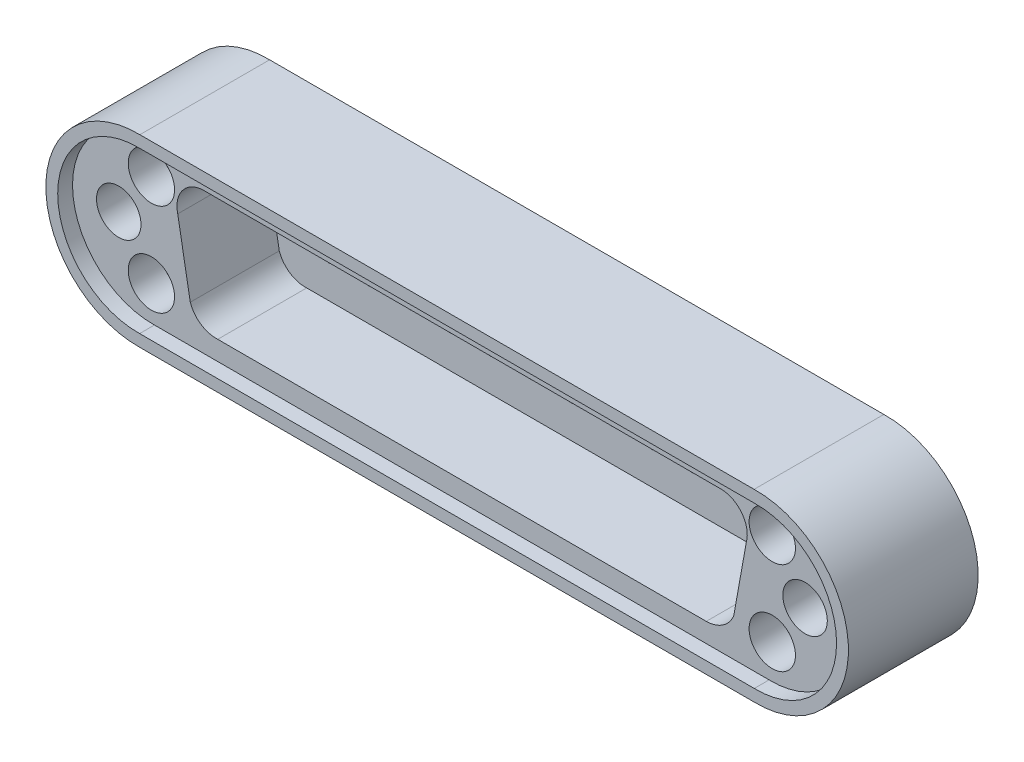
ISO-10303-21;
HEADER;
FILE_DESCRIPTION(('STEP AP214'),'2;1');
FILE_NAME('part.step','',(''),(''),'','','');
FILE_SCHEMA(('AUTOMOTIVE_DESIGN { 1 0 10303 214 1 1 1 1 }'));
ENDSEC;
DATA;
#1=APPLICATION_CONTEXT('core data for automotive mechanical design processes');
#2=APPLICATION_PROTOCOL_DEFINITION('international standard','automotive_design',2000,#1);
#3=PRODUCT_CONTEXT('',#1,'mechanical');
#4=PRODUCT('Part','Part','',(#3));
#5=PRODUCT_RELATED_PRODUCT_CATEGORY('part','',(#4));
#6=PRODUCT_DEFINITION_FORMATION('','',#4);
#7=PRODUCT_DEFINITION_CONTEXT('part definition',#1,'design');
#8=PRODUCT_DEFINITION('design','',#6,#7);
#9=PRODUCT_DEFINITION_SHAPE('','',#8);
#10=(LENGTH_UNIT() NAMED_UNIT(*) SI_UNIT(.MILLI.,.METRE.));
#11=(NAMED_UNIT(*) PLANE_ANGLE_UNIT() SI_UNIT($,.RADIAN.));
#12=(NAMED_UNIT(*) SI_UNIT($,.STERADIAN.) SOLID_ANGLE_UNIT());
#13=UNCERTAINTY_MEASURE_WITH_UNIT(LENGTH_MEASURE(1.E-05),#10,'distance_accuracy_value','');
#14=(GEOMETRIC_REPRESENTATION_CONTEXT(3) GLOBAL_UNCERTAINTY_ASSIGNED_CONTEXT((#13)) GLOBAL_UNIT_ASSIGNED_CONTEXT((#10,
#11,#12)) REPRESENTATION_CONTEXT('',''));
#15=CARTESIAN_POINT('',(0.,0.,0.));
#16=DIRECTION('',(0.,0.,1.));
#17=DIRECTION('',(1.,0.,0.));
#18=AXIS2_PLACEMENT_3D('',#15,#16,#17);
#19=CARTESIAN_POINT('',(-23.5226865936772,0.,8.89));
#20=DIRECTION('',(0.,0.,-1.));
#21=DIRECTION('',(-1.,0.,0.));
#22=AXIS2_PLACEMENT_3D('',#19,#20,#21);
#23=CYLINDRICAL_SURFACE('',#22,1.524);
#24=CARTESIAN_POINT('',(-23.5226865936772,0.,7.874));
#25=DIRECTION('',(0.,0.,1.));
#26=DIRECTION('',(1.,0.,0.));
#27=AXIS2_PLACEMENT_3D('',#24,#25,#26);
#28=CIRCLE('',#27,1.524);
#29=CARTESIAN_POINT('',(-21.9986865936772,0.,7.874));
#30=VERTEX_POINT('',#29);
#31=EDGE_CURVE('E500',#30,#30,#28,.T.);
#32=ORIENTED_EDGE('',*,*,#31,.T.);
#33=EDGE_LOOP('',(#32));
#34=FACE_BOUND('',#33,.T.);
#35=CARTESIAN_POINT('',(-23.5226865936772,0.,1.524));
#36=DIRECTION('',(0.,0.,-1.));
#37=DIRECTION('',(-1.,0.,0.));
#38=AXIS2_PLACEMENT_3D('',#35,#36,#37);
#39=CIRCLE('',#38,1.524);
#40=CARTESIAN_POINT('',(-25.0466865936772,0.,1.524));
#41=VERTEX_POINT('',#40);
#42=EDGE_CURVE('E39',#41,#41,#39,.T.);
#43=ORIENTED_EDGE('',*,*,#42,.T.);
#44=EDGE_LOOP('',(#43));
#45=FACE_BOUND('',#44,.T.);
#46=ADVANCED_FACE('F36',(#34,#45),#23,.F.);
#47=CARTESIAN_POINT('',(23.5079534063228,0.,8.89));
#48=DIRECTION('',(0.,0.,-1.));
#49=DIRECTION('',(-1.,0.,0.));
#50=AXIS2_PLACEMENT_3D('',#47,#48,#49);
#51=CYLINDRICAL_SURFACE('',#50,1.524);
#52=CARTESIAN_POINT('',(23.5079534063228,0.,7.874));
#53=DIRECTION('',(0.,0.,1.));
#54=DIRECTION('',(1.,0.,0.));
#55=AXIS2_PLACEMENT_3D('',#52,#53,#54);
#56=CIRCLE('',#55,1.524);
#57=CARTESIAN_POINT('',(25.0319534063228,0.,7.874));
#58=VERTEX_POINT('',#57);
#59=EDGE_CURVE('E503',#58,#58,#56,.T.);
#60=ORIENTED_EDGE('',*,*,#59,.T.);
#61=EDGE_LOOP('',(#60));
#62=FACE_BOUND('',#61,.T.);
#63=CARTESIAN_POINT('',(23.5079534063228,0.,1.524));
#64=DIRECTION('',(0.,0.,-1.));
#65=DIRECTION('',(-1.,0.,0.));
#66=AXIS2_PLACEMENT_3D('',#63,#64,#65);
#67=CIRCLE('',#66,1.524);
#68=CARTESIAN_POINT('',(21.9839534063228,0.,1.524));
#69=VERTEX_POINT('',#68);
#70=EDGE_CURVE('E312',#69,#69,#67,.T.);
#71=ORIENTED_EDGE('',*,*,#70,.T.);
#72=EDGE_LOOP('',(#71));
#73=FACE_BOUND('',#72,.T.);
#74=ADVANCED_FACE('F695',(#62,#73),#51,.F.);
#75=CARTESIAN_POINT('',(21.1813390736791,1.20439350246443E-05,7.874));
#76=DIRECTION('',(0.,0.,1.));
#77=DIRECTION('',(1.,0.,0.));
#78=AXIS2_PLACEMENT_3D('',#75,#76,#77);
#79=PLANE('',#78);
#80=CARTESIAN_POINT('',(-21.2849465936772,-3.1369,7.874));
#81=DIRECTION('',(0.,0.,1.));
#82=DIRECTION('',(1.,0.,0.));
#83=AXIS2_PLACEMENT_3D('',#80,#81,#82);
#84=CIRCLE('',#83,1.5875);
#85=CARTESIAN_POINT('',(-19.6974465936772,-3.1369,7.874));
#86=VERTEX_POINT('',#85);
#87=EDGE_CURVE('E494',#86,#86,#84,.F.);
#88=ORIENTED_EDGE('',*,*,#87,.T.);
#89=EDGE_LOOP('',(#88));
#90=FACE_BOUND('',#89,.T.);
#91=CARTESIAN_POINT('',(21.2600534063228,-3.1369,7.874));
#92=DIRECTION('',(0.,0.,1.));
#93=DIRECTION('',(1.,0.,0.));
#94=AXIS2_PLACEMENT_3D('',#91,#92,#93);
#95=CIRCLE('',#94,1.5875);
#96=CARTESIAN_POINT('',(22.8475534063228,-3.1369,7.874));
#97=VERTEX_POINT('',#96);
#98=EDGE_CURVE('E484',#97,#97,#95,.F.);
#99=ORIENTED_EDGE('',*,*,#98,.T.);
#100=EDGE_LOOP('',(#99));
#101=FACE_BOUND('',#100,.T.);
#102=CARTESIAN_POINT('',(21.1813390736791,1.20439350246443E-05,7.874));
#103=DIRECTION('',(0.,0.,1.));
#104=DIRECTION('',(1.,0.,0.));
#105=AXIS2_PLACEMENT_3D('',#102,#103,#104);
#106=CIRCLE('',#105,5.50083879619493);
#107=CARTESIAN_POINT('',(21.0435196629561,-5.4991,7.874));
#108=VERTEX_POINT('',#107);
#109=CARTESIAN_POINT('',(21.0425618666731,5.4991,7.874));
#110=VERTEX_POINT('',#109);
#111=EDGE_CURVE('E459',#108,#110,#106,.T.);
#112=ORIENTED_EDGE('',*,*,#111,.T.);
#113=DIRECTION('',(-1.,0.,0.));
#114=VECTOR('',#113,1.);
#115=CARTESIAN_POINT('',(21.0425618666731,5.4991,7.874));
#116=LINE('',#115,#114);
#117=CARTESIAN_POINT('',(-21.0664176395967,5.4991,7.874));
#118=VERTEX_POINT('',#117);
#119=EDGE_CURVE('E462',#110,#118,#116,.T.);
#120=ORIENTED_EDGE('',*,*,#119,.T.);
#121=CARTESIAN_POINT('',(-21.1883837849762,9.09584772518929E-06,7.874));
#122=DIRECTION('',(0.,0.,1.));
#123=DIRECTION('',(1.,0.,0.));
#124=AXIS2_PLACEMENT_3D('',#121,#122,#123);
#125=CIRCLE('',#124,5.50044330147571);
#126=CARTESIAN_POINT('',(-21.0753066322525,-5.49927177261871,7.874));
#127=VERTEX_POINT('',#126);
#128=EDGE_CURVE('E466',#118,#127,#125,.T.);
#129=ORIENTED_EDGE('',*,*,#128,.T.);
#130=DIRECTION('',(0.999999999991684,4.07828597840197E-06,0.));
#131=VECTOR('',#130,1.);
#132=CARTESIAN_POINT('',(-21.0753066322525,-5.49927177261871,7.874));
#133=LINE('',#132,#131);
#134=EDGE_CURVE('E469',#127,#108,#133,.T.);
#135=ORIENTED_EDGE('',*,*,#134,.T.);
#136=EDGE_LOOP('',(#112,#120,#129,#135));
#137=FACE_BOUND('',#136,.T.);
#138=CARTESIAN_POINT('',(21.2600534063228,3.2131,7.874));
#139=DIRECTION('',(0.,0.,1.));
#140=DIRECTION('',(1.,0.,0.));
#141=AXIS2_PLACEMENT_3D('',#138,#139,#140);
#142=CIRCLE('',#141,1.5875);
#143=CARTESIAN_POINT('',(22.8475534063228,3.2131,7.874));
#144=VERTEX_POINT('',#143);
#145=EDGE_CURVE('E491',#144,#144,#142,.F.);
#146=ORIENTED_EDGE('',*,*,#145,.T.);
#147=EDGE_LOOP('',(#146));
#148=FACE_BOUND('',#147,.T.);
#149=CARTESIAN_POINT('',(-21.2849465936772,3.2131,7.874));
#150=DIRECTION('',(0.,0.,1.));
#151=DIRECTION('',(1.,0.,0.));
#152=AXIS2_PLACEMENT_3D('',#149,#150,#151);
#153=CIRCLE('',#152,1.5875);
#154=CARTESIAN_POINT('',(-19.6974465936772,3.2131,7.874));
#155=VERTEX_POINT('',#154);
#156=EDGE_CURVE('E497',#155,#155,#153,.F.);
#157=ORIENTED_EDGE('',*,*,#156,.T.);
#158=EDGE_LOOP('',(#157));
#159=FACE_BOUND('',#158,.T.);
#160=ORIENTED_EDGE('',*,*,#31,.F.);
#161=EDGE_LOOP('',(#160));
#162=FACE_BOUND('',#161,.T.);
#163=ORIENTED_EDGE('',*,*,#59,.F.);
#164=EDGE_LOOP('',(#163));
#165=FACE_BOUND('',#164,.T.);
#166=CARTESIAN_POINT('',(-17.6794355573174,2.32627693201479,7.874));
#167=DIRECTION('',(0.,0.,1.));
#168=DIRECTION('',(1.,0.,0.));
#169=AXIS2_PLACEMENT_3D('',#166,#167,#168);
#170=CIRCLE('',#169,1.8535477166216);
#171=CARTESIAN_POINT('',(-17.7546,4.1783,7.874));
#172=VERTEX_POINT('',#171);
#173=CARTESIAN_POINT('',(-19.4818,1.89370144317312,7.874));
#174=VERTEX_POINT('',#173);
#175=EDGE_CURVE('E326',#172,#174,#170,.T.);
#176=ORIENTED_EDGE('',*,*,#175,.F.);
#177=DIRECTION('',(1.,0.,0.));
#178=VECTOR('',#177,1.);
#179=CARTESIAN_POINT('',(-17.7546,4.1783,7.874));
#180=LINE('',#179,#178);
#181=CARTESIAN_POINT('',(17.7546,4.1783,7.874));
#182=VERTEX_POINT('',#181);
#183=EDGE_CURVE('E345',#172,#182,#180,.T.);
#184=ORIENTED_EDGE('',*,*,#183,.T.);
#185=CARTESIAN_POINT('',(17.73629271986,2.36726306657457,7.874));
#186=DIRECTION('',(0.,0.,-1.));
#187=DIRECTION('',(-1.,0.,0.));
#188=AXIS2_PLACEMENT_3D('',#185,#186,#187);
#189=CIRCLE('',#188,1.81112946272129);
#190=CARTESIAN_POINT('',(19.4818,1.88415410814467,7.874));
#191=VERTEX_POINT('',#190);
#192=EDGE_CURVE('E348',#182,#191,#189,.T.);
#193=ORIENTED_EDGE('',*,*,#192,.T.);
#194=DIRECTION('',(-0.176961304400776,-0.984217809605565,0.));
#195=VECTOR('',#194,1.);
#196=CARTESIAN_POINT('',(19.4818,1.88415410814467,7.874));
#197=LINE('',#196,#195);
#198=CARTESIAN_POINT('',(18.6182,-2.91898917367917,7.874));
#199=VERTEX_POINT('',#198);
#200=EDGE_CURVE('E351',#191,#199,#197,.T.);
#201=ORIENTED_EDGE('',*,*,#200,.T.);
#202=CARTESIAN_POINT('',(16.7282705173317,-2.13051703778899,7.874));
#203=DIRECTION('',(0.,0.,-1.));
#204=DIRECTION('',(-1.,0.,0.));
#205=AXIS2_PLACEMENT_3D('',#202,#203,#204);
#206=CIRCLE('',#205,2.0478090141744);
#207=CARTESIAN_POINT('',(16.7386,-4.1783,7.874));
#208=VERTEX_POINT('',#207);
#209=EDGE_CURVE('E354',#199,#208,#206,.T.);
#210=ORIENTED_EDGE('',*,*,#209,.T.);
#211=DIRECTION('',(1.,0.,0.));
#212=VECTOR('',#211,1.);
#213=CARTESIAN_POINT('',(-16.7386,-4.1783,7.874));
#214=LINE('',#213,#212);
#215=CARTESIAN_POINT('',(-16.7386,-4.1783,7.874));
#216=VERTEX_POINT('',#215);
#217=EDGE_CURVE('E357',#216,#208,#214,.T.);
#218=ORIENTED_EDGE('',*,*,#217,.F.);
#219=CARTESIAN_POINT('',(-16.8477399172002,-2.30890479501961,7.874));
#220=DIRECTION('',(0.,0.,1.));
#221=DIRECTION('',(1.,0.,0.));
#222=AXIS2_PLACEMENT_3D('',#219,#220,#221);
#223=CIRCLE('',#222,1.87257842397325);
#224=CARTESIAN_POINT('',(-18.6182,-2.91884007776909,7.874));
#225=VERTEX_POINT('',#224);
#226=EDGE_CURVE('E360',#225,#216,#223,.T.);
#227=ORIENTED_EDGE('',*,*,#226,.F.);
#228=DIRECTION('',(0.176626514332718,-0.984277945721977,0.));
#229=VECTOR('',#228,1.);
#230=CARTESIAN_POINT('',(-19.4818,1.89370144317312,7.874));
#231=LINE('',#230,#229);
#232=EDGE_CURVE('E363',#174,#225,#231,.T.);
#233=ORIENTED_EDGE('',*,*,#232,.F.);
#234=EDGE_LOOP('',(#176,#184,#193,#201,#210,#218,#227,#233));
#235=FACE_BOUND('',#234,.T.);
#236=ADVANCED_FACE('F807',(#90,#101,#137,#148,#159,#162,#165,#235),#79,.T.);
#237=CARTESIAN_POINT('',(0.,1.4224,-6.81494317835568E-05));
#238=DIRECTION('',(0.,0.,1.));
#239=DIRECTION('',(1.,0.,0.));
#240=AXIS2_PLACEMENT_3D('',#237,#238,#239);
#241=CYLINDRICAL_SURFACE('',#240,0.508);
#242=CARTESIAN_POINT('',(0.,1.4224,1.778));
#243=DIRECTION('',(0.,0.,-1.));
#244=DIRECTION('',(-1.,0.,0.));
#245=AXIS2_PLACEMENT_3D('',#242,#243,#244);
#246=CIRCLE('',#245,0.508);
#247=CARTESIAN_POINT('',(-0.508,1.4224,1.778));
#248=VERTEX_POINT('',#247);
#249=EDGE_CURVE('E455',#248,#248,#246,.F.);
#250=ORIENTED_EDGE('',*,*,#249,.T.);
#251=EDGE_LOOP('',(#250));
#252=FACE_BOUND('',#251,.T.);
#253=CARTESIAN_POINT('',(0.,1.4224,0.));
#254=DIRECTION('',(0.,0.,1.));
#255=DIRECTION('',(1.,0.,0.));
#256=AXIS2_PLACEMENT_3D('',#253,#254,#255);
#257=CIRCLE('',#256,0.508);
#258=CARTESIAN_POINT('',(0.508,1.4224,0.));
#259=VERTEX_POINT('',#258);
#260=EDGE_CURVE('E543',#259,#259,#257,.T.);
#261=ORIENTED_EDGE('',*,*,#260,.F.);
#262=EDGE_LOOP('',(#261));
#263=FACE_BOUND('',#262,.T.);
#264=ADVANCED_FACE('F891',(#252,#263),#241,.F.);
#265=CARTESIAN_POINT('',(-1.3843,-1.4224,-6.81494317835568E-05));
#266=DIRECTION('',(0.,0.,1.));
#267=DIRECTION('',(1.,0.,0.));
#268=AXIS2_PLACEMENT_3D('',#265,#266,#267);
#269=CYLINDRICAL_SURFACE('',#268,0.508);
#270=CARTESIAN_POINT('',(-1.3843,-1.4224,1.778));
#271=DIRECTION('',(0.,0.,-1.));
#272=DIRECTION('',(-1.,0.,0.));
#273=AXIS2_PLACEMENT_3D('',#270,#271,#272);
#274=CIRCLE('',#273,0.508);
#275=CARTESIAN_POINT('',(-1.8923,-1.4224,1.778));
#276=VERTEX_POINT('',#275);
#277=EDGE_CURVE('E452',#276,#276,#274,.F.);
#278=ORIENTED_EDGE('',*,*,#277,.T.);
#279=EDGE_LOOP('',(#278));
#280=FACE_BOUND('',#279,.T.);
#281=CARTESIAN_POINT('',(-1.3843,-1.4224,0.));
#282=DIRECTION('',(0.,0.,1.));
#283=DIRECTION('',(1.,0.,0.));
#284=AXIS2_PLACEMENT_3D('',#281,#282,#283);
#285=CIRCLE('',#284,0.508);
#286=CARTESIAN_POINT('',(-0.8763,-1.4224,0.));
#287=VERTEX_POINT('',#286);
#288=EDGE_CURVE('E609',#287,#287,#285,.T.);
#289=ORIENTED_EDGE('',*,*,#288,.F.);
#290=EDGE_LOOP('',(#289));
#291=FACE_BOUND('',#290,.T.);
#292=ADVANCED_FACE('F1031',(#280,#291),#269,.F.);
#293=CARTESIAN_POINT('',(2.7686,1.4224,-6.81494317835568E-05));
#294=DIRECTION('',(0.,0.,1.));
#295=DIRECTION('',(1.,0.,0.));
#296=AXIS2_PLACEMENT_3D('',#293,#294,#295);
#297=CYLINDRICAL_SURFACE('',#296,0.508);
#298=CARTESIAN_POINT('',(2.7686,1.4224,1.778));
#299=DIRECTION('',(0.,0.,-1.));
#300=DIRECTION('',(-1.,0.,0.));
#301=AXIS2_PLACEMENT_3D('',#298,#299,#300);
#302=CIRCLE('',#301,0.508);
#303=CARTESIAN_POINT('',(2.2606,1.4224,1.778));
#304=VERTEX_POINT('',#303);
#305=EDGE_CURVE('E449',#304,#304,#302,.F.);
#306=ORIENTED_EDGE('',*,*,#305,.T.);
#307=EDGE_LOOP('',(#306));
#308=FACE_BOUND('',#307,.T.);
#309=CARTESIAN_POINT('',(2.7686,1.4224,0.));
#310=DIRECTION('',(0.,0.,1.));
#311=DIRECTION('',(1.,0.,0.));
#312=AXIS2_PLACEMENT_3D('',#309,#310,#311);
#313=CIRCLE('',#312,0.508);
#314=CARTESIAN_POINT('',(3.2766,1.4224,0.));
#315=VERTEX_POINT('',#314);
#316=EDGE_CURVE('E612',#315,#315,#313,.T.);
#317=ORIENTED_EDGE('',*,*,#316,.F.);
#318=EDGE_LOOP('',(#317));
#319=FACE_BOUND('',#318,.T.);
#320=ADVANCED_FACE('F1027',(#308,#319),#297,.F.);
#321=CARTESIAN_POINT('',(5.5372,1.4224,-6.81494317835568E-05));
#322=DIRECTION('',(0.,0.,1.));
#323=DIRECTION('',(1.,0.,0.));
#324=AXIS2_PLACEMENT_3D('',#321,#322,#323);
#325=CYLINDRICAL_SURFACE('',#324,0.508);
#326=CARTESIAN_POINT('',(5.5372,1.4224,1.778));
#327=DIRECTION('',(0.,0.,-1.));
#328=DIRECTION('',(-1.,0.,0.));
#329=AXIS2_PLACEMENT_3D('',#326,#327,#328);
#330=CIRCLE('',#329,0.508);
#331=CARTESIAN_POINT('',(5.0292,1.4224,1.778));
#332=VERTEX_POINT('',#331);
#333=EDGE_CURVE('E446',#332,#332,#330,.F.);
#334=ORIENTED_EDGE('',*,*,#333,.T.);
#335=EDGE_LOOP('',(#334));
#336=FACE_BOUND('',#335,.T.);
#337=CARTESIAN_POINT('',(5.5372,1.4224,0.));
#338=DIRECTION('',(0.,0.,1.));
#339=DIRECTION('',(1.,0.,0.));
#340=AXIS2_PLACEMENT_3D('',#337,#338,#339);
#341=CIRCLE('',#340,0.508);
#342=CARTESIAN_POINT('',(6.0452,1.4224,0.));
#343=VERTEX_POINT('',#342);
#344=EDGE_CURVE('E615',#343,#343,#341,.T.);
#345=ORIENTED_EDGE('',*,*,#344,.F.);
#346=EDGE_LOOP('',(#345));
#347=FACE_BOUND('',#346,.T.);
#348=ADVANCED_FACE('F1023',(#336,#347),#325,.F.);
#349=CARTESIAN_POINT('',(8.3058,1.4224,-6.81494317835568E-05));
#350=DIRECTION('',(0.,0.,1.));
#351=DIRECTION('',(1.,0.,0.));
#352=AXIS2_PLACEMENT_3D('',#349,#350,#351);
#353=CYLINDRICAL_SURFACE('',#352,0.508);
#354=CARTESIAN_POINT('',(8.3058,1.4224,1.778));
#355=DIRECTION('',(0.,0.,-1.));
#356=DIRECTION('',(-1.,0.,0.));
#357=AXIS2_PLACEMENT_3D('',#354,#355,#356);
#358=CIRCLE('',#357,0.508);
#359=CARTESIAN_POINT('',(7.7978,1.4224,1.778));
#360=VERTEX_POINT('',#359);
#361=EDGE_CURVE('E443',#360,#360,#358,.F.);
#362=ORIENTED_EDGE('',*,*,#361,.T.);
#363=EDGE_LOOP('',(#362));
#364=FACE_BOUND('',#363,.T.);
#365=CARTESIAN_POINT('',(8.3058,1.4224,0.));
#366=DIRECTION('',(0.,0.,1.));
#367=DIRECTION('',(1.,0.,0.));
#368=AXIS2_PLACEMENT_3D('',#365,#366,#367);
#369=CIRCLE('',#368,0.508);
#370=CARTESIAN_POINT('',(8.8138,1.4224,0.));
#371=VERTEX_POINT('',#370);
#372=EDGE_CURVE('E618',#371,#371,#369,.T.);
#373=ORIENTED_EDGE('',*,*,#372,.F.);
#374=EDGE_LOOP('',(#373));
#375=FACE_BOUND('',#374,.T.);
#376=ADVANCED_FACE('F1019',(#364,#375),#353,.F.);
#377=CARTESIAN_POINT('',(11.0744,1.4224,-6.81494317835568E-05));
#378=DIRECTION('',(0.,0.,1.));
#379=DIRECTION('',(1.,0.,0.));
#380=AXIS2_PLACEMENT_3D('',#377,#378,#379);
#381=CYLINDRICAL_SURFACE('',#380,0.508);
#382=CARTESIAN_POINT('',(11.0744,1.4224,1.778));
#383=DIRECTION('',(0.,0.,-1.));
#384=DIRECTION('',(-1.,0.,0.));
#385=AXIS2_PLACEMENT_3D('',#382,#383,#384);
#386=CIRCLE('',#385,0.508);
#387=CARTESIAN_POINT('',(10.5664,1.4224,1.778));
#388=VERTEX_POINT('',#387);
#389=EDGE_CURVE('E440',#388,#388,#386,.F.);
#390=ORIENTED_EDGE('',*,*,#389,.T.);
#391=EDGE_LOOP('',(#390));
#392=FACE_BOUND('',#391,.T.);
#393=CARTESIAN_POINT('',(11.0744,1.4224,0.));
#394=DIRECTION('',(0.,0.,1.));
#395=DIRECTION('',(1.,0.,0.));
#396=AXIS2_PLACEMENT_3D('',#393,#394,#395);
#397=CIRCLE('',#396,0.508);
#398=CARTESIAN_POINT('',(11.5824,1.4224,0.));
#399=VERTEX_POINT('',#398);
#400=EDGE_CURVE('E621',#399,#399,#397,.T.);
#401=ORIENTED_EDGE('',*,*,#400,.F.);
#402=EDGE_LOOP('',(#401));
#403=FACE_BOUND('',#402,.T.);
#404=ADVANCED_FACE('F1015',(#392,#403),#381,.F.);
#405=CARTESIAN_POINT('',(13.843,1.4224,-6.81494317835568E-05));
#406=DIRECTION('',(0.,0.,1.));
#407=DIRECTION('',(1.,0.,0.));
#408=AXIS2_PLACEMENT_3D('',#405,#406,#407);
#409=CYLINDRICAL_SURFACE('',#408,0.508);
#410=CARTESIAN_POINT('',(13.843,1.4224,1.778));
#411=DIRECTION('',(0.,0.,-1.));
#412=DIRECTION('',(-1.,0.,0.));
#413=AXIS2_PLACEMENT_3D('',#410,#411,#412);
#414=CIRCLE('',#413,0.508);
#415=CARTESIAN_POINT('',(13.335,1.4224,1.778));
#416=VERTEX_POINT('',#415);
#417=EDGE_CURVE('E437',#416,#416,#414,.F.);
#418=ORIENTED_EDGE('',*,*,#417,.T.);
#419=EDGE_LOOP('',(#418));
#420=FACE_BOUND('',#419,.T.);
#421=CARTESIAN_POINT('',(13.843,1.4224,0.));
#422=DIRECTION('',(0.,0.,1.));
#423=DIRECTION('',(1.,0.,0.));
#424=AXIS2_PLACEMENT_3D('',#421,#422,#423);
#425=CIRCLE('',#424,0.508);
#426=CARTESIAN_POINT('',(14.351,1.4224,0.));
#427=VERTEX_POINT('',#426);
#428=EDGE_CURVE('E624',#427,#427,#425,.T.);
#429=ORIENTED_EDGE('',*,*,#428,.F.);
#430=EDGE_LOOP('',(#429));
#431=FACE_BOUND('',#430,.T.);
#432=ADVANCED_FACE('F1011',(#420,#431),#409,.F.);
#433=CARTESIAN_POINT('',(16.6116,1.4224,-6.81494317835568E-05));
#434=DIRECTION('',(0.,0.,1.));
#435=DIRECTION('',(1.,0.,0.));
#436=AXIS2_PLACEMENT_3D('',#433,#434,#435);
#437=CYLINDRICAL_SURFACE('',#436,0.507999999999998);
#438=CARTESIAN_POINT('',(16.6116,1.4224,1.778));
#439=DIRECTION('',(0.,0.,-1.));
#440=DIRECTION('',(-1.,0.,0.));
#441=AXIS2_PLACEMENT_3D('',#438,#439,#440);
#442=CIRCLE('',#441,0.507999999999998);
#443=CARTESIAN_POINT('',(16.1036,1.4224,1.778));
#444=VERTEX_POINT('',#443);
#445=EDGE_CURVE('E434',#444,#444,#442,.F.);
#446=ORIENTED_EDGE('',*,*,#445,.T.);
#447=EDGE_LOOP('',(#446));
#448=FACE_BOUND('',#447,.T.);
#449=CARTESIAN_POINT('',(16.6116,1.4224,0.));
#450=DIRECTION('',(0.,0.,1.));
#451=DIRECTION('',(1.,0.,0.));
#452=AXIS2_PLACEMENT_3D('',#449,#450,#451);
#453=CIRCLE('',#452,0.507999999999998);
#454=CARTESIAN_POINT('',(17.1196,1.4224,0.));
#455=VERTEX_POINT('',#454);
#456=EDGE_CURVE('E627',#455,#455,#453,.T.);
#457=ORIENTED_EDGE('',*,*,#456,.F.);
#458=EDGE_LOOP('',(#457));
#459=FACE_BOUND('',#458,.T.);
#460=ADVANCED_FACE('F1007',(#448,#459),#437,.F.);
#461=CARTESIAN_POINT('',(-2.54,1.42239999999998,-6.81494317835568E-05));
#462=DIRECTION('',(0.,0.,1.));
#463=DIRECTION('',(1.,0.,0.));
#464=AXIS2_PLACEMENT_3D('',#461,#462,#463);
#465=CYLINDRICAL_SURFACE('',#464,0.508);
#466=CARTESIAN_POINT('',(-2.54,1.42239999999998,1.778));
#467=DIRECTION('',(0.,0.,-1.));
#468=DIRECTION('',(-1.,0.,0.));
#469=AXIS2_PLACEMENT_3D('',#466,#467,#468);
#470=CIRCLE('',#469,0.508);
#471=CARTESIAN_POINT('',(-3.048,1.42239999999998,1.778));
#472=VERTEX_POINT('',#471);
#473=EDGE_CURVE('E431',#472,#472,#470,.F.);
#474=ORIENTED_EDGE('',*,*,#473,.T.);
#475=EDGE_LOOP('',(#474));
#476=FACE_BOUND('',#475,.T.);
#477=CARTESIAN_POINT('',(-2.54,1.42239999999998,0.));
#478=DIRECTION('',(0.,0.,1.));
#479=DIRECTION('',(1.,0.,0.));
#480=AXIS2_PLACEMENT_3D('',#477,#478,#479);
#481=CIRCLE('',#480,0.508);
#482=CARTESIAN_POINT('',(-2.032,1.42239999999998,0.));
#483=VERTEX_POINT('',#482);
#484=EDGE_CURVE('E630',#483,#483,#481,.T.);
#485=ORIENTED_EDGE('',*,*,#484,.F.);
#486=EDGE_LOOP('',(#485));
#487=FACE_BOUND('',#486,.T.);
#488=ADVANCED_FACE('F1003',(#476,#487),#465,.F.);
#489=CARTESIAN_POINT('',(-5.08,1.42239999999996,-6.81494317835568E-05));
#490=DIRECTION('',(0.,0.,1.));
#491=DIRECTION('',(1.,0.,0.));
#492=AXIS2_PLACEMENT_3D('',#489,#490,#491);
#493=CYLINDRICAL_SURFACE('',#492,0.508);
#494=CARTESIAN_POINT('',(-5.08,1.42239999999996,1.778));
#495=DIRECTION('',(0.,0.,-1.));
#496=DIRECTION('',(-1.,0.,0.));
#497=AXIS2_PLACEMENT_3D('',#494,#495,#496);
#498=CIRCLE('',#497,0.508);
#499=CARTESIAN_POINT('',(-5.588,1.42239999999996,1.778));
#500=VERTEX_POINT('',#499);
#501=EDGE_CURVE('E428',#500,#500,#498,.F.);
#502=ORIENTED_EDGE('',*,*,#501,.T.);
#503=EDGE_LOOP('',(#502));
#504=FACE_BOUND('',#503,.T.);
#505=CARTESIAN_POINT('',(-5.08,1.42239999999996,0.));
#506=DIRECTION('',(0.,0.,1.));
#507=DIRECTION('',(1.,0.,0.));
#508=AXIS2_PLACEMENT_3D('',#505,#506,#507);
#509=CIRCLE('',#508,0.508);
#510=CARTESIAN_POINT('',(-4.572,1.42239999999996,0.));
#511=VERTEX_POINT('',#510);
#512=EDGE_CURVE('E633',#511,#511,#509,.T.);
#513=ORIENTED_EDGE('',*,*,#512,.F.);
#514=EDGE_LOOP('',(#513));
#515=FACE_BOUND('',#514,.T.);
#516=ADVANCED_FACE('F999',(#504,#515),#493,.F.);
#517=CARTESIAN_POINT('',(-7.62,1.42239999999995,-6.81494317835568E-05));
#518=DIRECTION('',(0.,0.,1.));
#519=DIRECTION('',(1.,0.,0.));
#520=AXIS2_PLACEMENT_3D('',#517,#518,#519);
#521=CYLINDRICAL_SURFACE('',#520,0.508);
#522=CARTESIAN_POINT('',(-7.62,1.42239999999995,1.778));
#523=DIRECTION('',(0.,0.,-1.));
#524=DIRECTION('',(-1.,0.,0.));
#525=AXIS2_PLACEMENT_3D('',#522,#523,#524);
#526=CIRCLE('',#525,0.508);
#527=CARTESIAN_POINT('',(-8.128,1.42239999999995,1.778));
#528=VERTEX_POINT('',#527);
#529=EDGE_CURVE('E425',#528,#528,#526,.F.);
#530=ORIENTED_EDGE('',*,*,#529,.T.);
#531=EDGE_LOOP('',(#530));
#532=FACE_BOUND('',#531,.T.);
#533=CARTESIAN_POINT('',(-7.62,1.42239999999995,0.));
#534=DIRECTION('',(0.,0.,1.));
#535=DIRECTION('',(1.,0.,0.));
#536=AXIS2_PLACEMENT_3D('',#533,#534,#535);
#537=CIRCLE('',#536,0.508);
#538=CARTESIAN_POINT('',(-7.112,1.42239999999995,0.));
#539=VERTEX_POINT('',#538);
#540=EDGE_CURVE('E636',#539,#539,#537,.T.);
#541=ORIENTED_EDGE('',*,*,#540,.F.);
#542=EDGE_LOOP('',(#541));
#543=FACE_BOUND('',#542,.T.);
#544=ADVANCED_FACE('F995',(#532,#543),#521,.F.);
#545=CARTESIAN_POINT('',(-10.16,1.42239999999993,-6.81494317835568E-05));
#546=DIRECTION('',(0.,0.,1.));
#547=DIRECTION('',(1.,0.,0.));
#548=AXIS2_PLACEMENT_3D('',#545,#546,#547);
#549=CYLINDRICAL_SURFACE('',#548,0.508);
#550=CARTESIAN_POINT('',(-10.16,1.42239999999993,1.778));
#551=DIRECTION('',(0.,0.,-1.));
#552=DIRECTION('',(-1.,0.,0.));
#553=AXIS2_PLACEMENT_3D('',#550,#551,#552);
#554=CIRCLE('',#553,0.508);
#555=CARTESIAN_POINT('',(-10.668,1.42239999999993,1.778));
#556=VERTEX_POINT('',#555);
#557=EDGE_CURVE('E422',#556,#556,#554,.F.);
#558=ORIENTED_EDGE('',*,*,#557,.T.);
#559=EDGE_LOOP('',(#558));
#560=FACE_BOUND('',#559,.T.);
#561=CARTESIAN_POINT('',(-10.16,1.42239999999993,0.));
#562=DIRECTION('',(0.,0.,1.));
#563=DIRECTION('',(1.,0.,0.));
#564=AXIS2_PLACEMENT_3D('',#561,#562,#563);
#565=CIRCLE('',#564,0.508);
#566=CARTESIAN_POINT('',(-9.652,1.42239999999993,0.));
#567=VERTEX_POINT('',#566);
#568=EDGE_CURVE('E639',#567,#567,#565,.T.);
#569=ORIENTED_EDGE('',*,*,#568,.F.);
#570=EDGE_LOOP('',(#569));
#571=FACE_BOUND('',#570,.T.);
#572=ADVANCED_FACE('F991',(#560,#571),#549,.F.);
#573=CARTESIAN_POINT('',(-12.7,1.42239999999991,-6.81494317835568E-05));
#574=DIRECTION('',(0.,0.,1.));
#575=DIRECTION('',(1.,0.,0.));
#576=AXIS2_PLACEMENT_3D('',#573,#574,#575);
#577=CYLINDRICAL_SURFACE('',#576,0.508);
#578=CARTESIAN_POINT('',(-12.7,1.42239999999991,1.778));
#579=DIRECTION('',(0.,0.,-1.));
#580=DIRECTION('',(-1.,0.,0.));
#581=AXIS2_PLACEMENT_3D('',#578,#579,#580);
#582=CIRCLE('',#581,0.508);
#583=CARTESIAN_POINT('',(-13.208,1.42239999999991,1.778));
#584=VERTEX_POINT('',#583);
#585=EDGE_CURVE('E419',#584,#584,#582,.F.);
#586=ORIENTED_EDGE('',*,*,#585,.T.);
#587=EDGE_LOOP('',(#586));
#588=FACE_BOUND('',#587,.T.);
#589=CARTESIAN_POINT('',(-12.7,1.42239999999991,0.));
#590=DIRECTION('',(0.,0.,1.));
#591=DIRECTION('',(1.,0.,0.));
#592=AXIS2_PLACEMENT_3D('',#589,#590,#591);
#593=CIRCLE('',#592,0.508);
#594=CARTESIAN_POINT('',(-12.192,1.42239999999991,0.));
#595=VERTEX_POINT('',#594);
#596=EDGE_CURVE('E642',#595,#595,#593,.T.);
#597=ORIENTED_EDGE('',*,*,#596,.F.);
#598=EDGE_LOOP('',(#597));
#599=FACE_BOUND('',#598,.T.);
#600=ADVANCED_FACE('F987',(#588,#599),#577,.F.);
#601=CARTESIAN_POINT('',(-15.24,1.42239999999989,-6.81494317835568E-05));
#602=DIRECTION('',(0.,0.,1.));
#603=DIRECTION('',(1.,0.,0.));
#604=AXIS2_PLACEMENT_3D('',#601,#602,#603);
#605=CYLINDRICAL_SURFACE('',#604,0.508);
#606=CARTESIAN_POINT('',(-15.24,1.42239999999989,1.778));
#607=DIRECTION('',(0.,0.,-1.));
#608=DIRECTION('',(-1.,0.,0.));
#609=AXIS2_PLACEMENT_3D('',#606,#607,#608);
#610=CIRCLE('',#609,0.508);
#611=CARTESIAN_POINT('',(-15.748,1.42239999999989,1.778));
#612=VERTEX_POINT('',#611);
#613=EDGE_CURVE('E416',#612,#612,#610,.F.);
#614=ORIENTED_EDGE('',*,*,#613,.T.);
#615=EDGE_LOOP('',(#614));
#616=FACE_BOUND('',#615,.T.);
#617=CARTESIAN_POINT('',(-15.24,1.42239999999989,0.));
#618=DIRECTION('',(0.,0.,1.));
#619=DIRECTION('',(1.,0.,0.));
#620=AXIS2_PLACEMENT_3D('',#617,#618,#619);
#621=CIRCLE('',#620,0.508);
#622=CARTESIAN_POINT('',(-14.732,1.42239999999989,0.));
#623=VERTEX_POINT('',#622);
#624=EDGE_CURVE('E645',#623,#623,#621,.T.);
#625=ORIENTED_EDGE('',*,*,#624,.F.);
#626=EDGE_LOOP('',(#625));
#627=FACE_BOUND('',#626,.T.);
#628=ADVANCED_FACE('F983',(#616,#627),#605,.F.);
#629=CARTESIAN_POINT('',(1.3843,-1.4224,-6.81494317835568E-05));
#630=DIRECTION('',(0.,0.,1.));
#631=DIRECTION('',(1.,0.,0.));
#632=AXIS2_PLACEMENT_3D('',#629,#630,#631);
#633=CYLINDRICAL_SURFACE('',#632,0.508);
#634=CARTESIAN_POINT('',(1.3843,-1.4224,1.778));
#635=DIRECTION('',(0.,0.,-1.));
#636=DIRECTION('',(-1.,0.,0.));
#637=AXIS2_PLACEMENT_3D('',#634,#635,#636);
#638=CIRCLE('',#637,0.508);
#639=CARTESIAN_POINT('',(0.8763,-1.4224,1.778));
#640=VERTEX_POINT('',#639);
#641=EDGE_CURVE('E413',#640,#640,#638,.F.);
#642=ORIENTED_EDGE('',*,*,#641,.T.);
#643=EDGE_LOOP('',(#642));
#644=FACE_BOUND('',#643,.T.);
#645=CARTESIAN_POINT('',(1.3843,-1.4224,0.));
#646=DIRECTION('',(0.,0.,1.));
#647=DIRECTION('',(1.,0.,0.));
#648=AXIS2_PLACEMENT_3D('',#645,#646,#647);
#649=CIRCLE('',#648,0.508);
#650=CARTESIAN_POINT('',(1.8923,-1.4224,0.));
#651=VERTEX_POINT('',#650);
#652=EDGE_CURVE('E648',#651,#651,#649,.T.);
#653=ORIENTED_EDGE('',*,*,#652,.F.);
#654=EDGE_LOOP('',(#653));
#655=FACE_BOUND('',#654,.T.);
#656=ADVANCED_FACE('F979',(#644,#655),#633,.F.);
#657=CARTESIAN_POINT('',(4.1529,-1.4224,-6.81494317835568E-05));
#658=DIRECTION('',(0.,0.,1.));
#659=DIRECTION('',(1.,0.,0.));
#660=AXIS2_PLACEMENT_3D('',#657,#658,#659);
#661=CYLINDRICAL_SURFACE('',#660,0.507999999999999);
#662=CARTESIAN_POINT('',(4.1529,-1.4224,1.778));
#663=DIRECTION('',(0.,0.,-1.));
#664=DIRECTION('',(-1.,0.,0.));
#665=AXIS2_PLACEMENT_3D('',#662,#663,#664);
#666=CIRCLE('',#665,0.507999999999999);
#667=CARTESIAN_POINT('',(3.6449,-1.4224,1.778));
#668=VERTEX_POINT('',#667);
#669=EDGE_CURVE('E410',#668,#668,#666,.F.);
#670=ORIENTED_EDGE('',*,*,#669,.T.);
#671=EDGE_LOOP('',(#670));
#672=FACE_BOUND('',#671,.T.);
#673=CARTESIAN_POINT('',(4.1529,-1.4224,0.));
#674=DIRECTION('',(0.,0.,1.));
#675=DIRECTION('',(1.,0.,0.));
#676=AXIS2_PLACEMENT_3D('',#673,#674,#675);
#677=CIRCLE('',#676,0.507999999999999);
#678=CARTESIAN_POINT('',(4.6609,-1.4224,0.));
#679=VERTEX_POINT('',#678);
#680=EDGE_CURVE('E651',#679,#679,#677,.T.);
#681=ORIENTED_EDGE('',*,*,#680,.F.);
#682=EDGE_LOOP('',(#681));
#683=FACE_BOUND('',#682,.T.);
#684=ADVANCED_FACE('F975',(#672,#683),#661,.F.);
#685=CARTESIAN_POINT('',(6.9215,-1.4224,-6.81494317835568E-05));
#686=DIRECTION('',(0.,0.,1.));
#687=DIRECTION('',(1.,0.,0.));
#688=AXIS2_PLACEMENT_3D('',#685,#686,#687);
#689=CYLINDRICAL_SURFACE('',#688,0.507999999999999);
#690=CARTESIAN_POINT('',(6.9215,-1.4224,1.778));
#691=DIRECTION('',(0.,0.,-1.));
#692=DIRECTION('',(-1.,0.,0.));
#693=AXIS2_PLACEMENT_3D('',#690,#691,#692);
#694=CIRCLE('',#693,0.507999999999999);
#695=CARTESIAN_POINT('',(6.4135,-1.4224,1.778));
#696=VERTEX_POINT('',#695);
#697=EDGE_CURVE('E407',#696,#696,#694,.F.);
#698=ORIENTED_EDGE('',*,*,#697,.T.);
#699=EDGE_LOOP('',(#698));
#700=FACE_BOUND('',#699,.T.);
#701=CARTESIAN_POINT('',(6.9215,-1.4224,0.));
#702=DIRECTION('',(0.,0.,1.));
#703=DIRECTION('',(1.,0.,0.));
#704=AXIS2_PLACEMENT_3D('',#701,#702,#703);
#705=CIRCLE('',#704,0.507999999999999);
#706=CARTESIAN_POINT('',(7.4295,-1.4224,0.));
#707=VERTEX_POINT('',#706);
#708=EDGE_CURVE('E654',#707,#707,#705,.T.);
#709=ORIENTED_EDGE('',*,*,#708,.F.);
#710=EDGE_LOOP('',(#709));
#711=FACE_BOUND('',#710,.T.);
#712=ADVANCED_FACE('F971',(#700,#711),#689,.F.);
#713=CARTESIAN_POINT('',(9.6901,-1.4224,-6.81494317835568E-05));
#714=DIRECTION('',(0.,0.,1.));
#715=DIRECTION('',(1.,0.,0.));
#716=AXIS2_PLACEMENT_3D('',#713,#714,#715);
#717=CYLINDRICAL_SURFACE('',#716,0.508);
#718=CARTESIAN_POINT('',(9.6901,-1.4224,1.778));
#719=DIRECTION('',(0.,0.,-1.));
#720=DIRECTION('',(-1.,0.,0.));
#721=AXIS2_PLACEMENT_3D('',#718,#719,#720);
#722=CIRCLE('',#721,0.508);
#723=CARTESIAN_POINT('',(9.1821,-1.4224,1.778));
#724=VERTEX_POINT('',#723);
#725=EDGE_CURVE('E404',#724,#724,#722,.F.);
#726=ORIENTED_EDGE('',*,*,#725,.T.);
#727=EDGE_LOOP('',(#726));
#728=FACE_BOUND('',#727,.T.);
#729=CARTESIAN_POINT('',(9.6901,-1.4224,0.));
#730=DIRECTION('',(0.,0.,1.));
#731=DIRECTION('',(1.,0.,0.));
#732=AXIS2_PLACEMENT_3D('',#729,#730,#731);
#733=CIRCLE('',#732,0.508);
#734=CARTESIAN_POINT('',(10.1981,-1.4224,0.));
#735=VERTEX_POINT('',#734);
#736=EDGE_CURVE('E657',#735,#735,#733,.T.);
#737=ORIENTED_EDGE('',*,*,#736,.F.);
#738=EDGE_LOOP('',(#737));
#739=FACE_BOUND('',#738,.T.);
#740=ADVANCED_FACE('F967',(#728,#739),#717,.F.);
#741=CARTESIAN_POINT('',(12.4587,-1.4224,-6.81494317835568E-05));
#742=DIRECTION('',(0.,0.,1.));
#743=DIRECTION('',(1.,0.,0.));
#744=AXIS2_PLACEMENT_3D('',#741,#742,#743);
#745=CYLINDRICAL_SURFACE('',#744,0.508);
#746=CARTESIAN_POINT('',(12.4587,-1.4224,1.778));
#747=DIRECTION('',(0.,0.,-1.));
#748=DIRECTION('',(-1.,0.,0.));
#749=AXIS2_PLACEMENT_3D('',#746,#747,#748);
#750=CIRCLE('',#749,0.508);
#751=CARTESIAN_POINT('',(11.9507,-1.4224,1.778));
#752=VERTEX_POINT('',#751);
#753=EDGE_CURVE('E401',#752,#752,#750,.F.);
#754=ORIENTED_EDGE('',*,*,#753,.T.);
#755=EDGE_LOOP('',(#754));
#756=FACE_BOUND('',#755,.T.);
#757=CARTESIAN_POINT('',(12.4587,-1.4224,0.));
#758=DIRECTION('',(0.,0.,1.));
#759=DIRECTION('',(1.,0.,0.));
#760=AXIS2_PLACEMENT_3D('',#757,#758,#759);
#761=CIRCLE('',#760,0.508);
#762=CARTESIAN_POINT('',(12.9667,-1.4224,0.));
#763=VERTEX_POINT('',#762);
#764=EDGE_CURVE('E660',#763,#763,#761,.T.);
#765=ORIENTED_EDGE('',*,*,#764,.F.);
#766=EDGE_LOOP('',(#765));
#767=FACE_BOUND('',#766,.T.);
#768=ADVANCED_FACE('F963',(#756,#767),#745,.F.);
#769=CARTESIAN_POINT('',(15.2273,-1.4224,-6.81494317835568E-05));
#770=DIRECTION('',(0.,0.,1.));
#771=DIRECTION('',(1.,0.,0.));
#772=AXIS2_PLACEMENT_3D('',#769,#770,#771);
#773=CYLINDRICAL_SURFACE('',#772,0.508);
#774=CARTESIAN_POINT('',(15.2273,-1.4224,1.778));
#775=DIRECTION('',(0.,0.,-1.));
#776=DIRECTION('',(-1.,0.,0.));
#777=AXIS2_PLACEMENT_3D('',#774,#775,#776);
#778=CIRCLE('',#777,0.508);
#779=CARTESIAN_POINT('',(14.7193,-1.4224,1.778));
#780=VERTEX_POINT('',#779);
#781=EDGE_CURVE('E398',#780,#780,#778,.F.);
#782=ORIENTED_EDGE('',*,*,#781,.T.);
#783=EDGE_LOOP('',(#782));
#784=FACE_BOUND('',#783,.T.);
#785=CARTESIAN_POINT('',(15.2273,-1.4224,0.));
#786=DIRECTION('',(0.,0.,1.));
#787=DIRECTION('',(1.,0.,0.));
#788=AXIS2_PLACEMENT_3D('',#785,#786,#787);
#789=CIRCLE('',#788,0.508);
#790=CARTESIAN_POINT('',(15.7353,-1.4224,0.));
#791=VERTEX_POINT('',#790);
#792=EDGE_CURVE('E663',#791,#791,#789,.T.);
#793=ORIENTED_EDGE('',*,*,#792,.F.);
#794=EDGE_LOOP('',(#793));
#795=FACE_BOUND('',#794,.T.);
#796=ADVANCED_FACE('F959',(#784,#795),#773,.F.);
#797=CARTESIAN_POINT('',(-4.1529,-1.42240000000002,-6.81494317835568E-05));
#798=DIRECTION('',(0.,0.,1.));
#799=DIRECTION('',(1.,0.,0.));
#800=AXIS2_PLACEMENT_3D('',#797,#798,#799);
#801=CYLINDRICAL_SURFACE('',#800,0.508);
#802=CARTESIAN_POINT('',(-4.1529,-1.42240000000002,1.778));
#803=DIRECTION('',(0.,0.,-1.));
#804=DIRECTION('',(-1.,0.,0.));
#805=AXIS2_PLACEMENT_3D('',#802,#803,#804);
#806=CIRCLE('',#805,0.508);
#807=CARTESIAN_POINT('',(-4.6609,-1.42240000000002,1.778));
#808=VERTEX_POINT('',#807);
#809=EDGE_CURVE('E395',#808,#808,#806,.F.);
#810=ORIENTED_EDGE('',*,*,#809,.T.);
#811=EDGE_LOOP('',(#810));
#812=FACE_BOUND('',#811,.T.);
#813=CARTESIAN_POINT('',(-4.1529,-1.42240000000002,0.));
#814=DIRECTION('',(0.,0.,1.));
#815=DIRECTION('',(1.,0.,0.));
#816=AXIS2_PLACEMENT_3D('',#813,#814,#815);
#817=CIRCLE('',#816,0.508);
#818=CARTESIAN_POINT('',(-3.6449,-1.42240000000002,0.));
#819=VERTEX_POINT('',#818);
#820=EDGE_CURVE('E666',#819,#819,#817,.T.);
#821=ORIENTED_EDGE('',*,*,#820,.F.);
#822=EDGE_LOOP('',(#821));
#823=FACE_BOUND('',#822,.T.);
#824=ADVANCED_FACE('F955',(#812,#823),#801,.F.);
#825=CARTESIAN_POINT('',(-6.9215,-1.42240000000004,-6.81494317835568E-05));
#826=DIRECTION('',(0.,0.,1.));
#827=DIRECTION('',(1.,0.,0.));
#828=AXIS2_PLACEMENT_3D('',#825,#826,#827);
#829=CYLINDRICAL_SURFACE('',#828,0.507999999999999);
#830=CARTESIAN_POINT('',(-6.9215,-1.42240000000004,1.778));
#831=DIRECTION('',(0.,0.,-1.));
#832=DIRECTION('',(-1.,0.,0.));
#833=AXIS2_PLACEMENT_3D('',#830,#831,#832);
#834=CIRCLE('',#833,0.507999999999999);
#835=CARTESIAN_POINT('',(-7.4295,-1.42240000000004,1.778));
#836=VERTEX_POINT('',#835);
#837=EDGE_CURVE('E392',#836,#836,#834,.F.);
#838=ORIENTED_EDGE('',*,*,#837,.T.);
#839=EDGE_LOOP('',(#838));
#840=FACE_BOUND('',#839,.T.);
#841=CARTESIAN_POINT('',(-6.9215,-1.42240000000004,0.));
#842=DIRECTION('',(0.,0.,1.));
#843=DIRECTION('',(1.,0.,0.));
#844=AXIS2_PLACEMENT_3D('',#841,#842,#843);
#845=CIRCLE('',#844,0.507999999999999);
#846=CARTESIAN_POINT('',(-6.4135,-1.42240000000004,0.));
#847=VERTEX_POINT('',#846);
#848=EDGE_CURVE('E669',#847,#847,#845,.T.);
#849=ORIENTED_EDGE('',*,*,#848,.F.);
#850=EDGE_LOOP('',(#849));
#851=FACE_BOUND('',#850,.T.);
#852=ADVANCED_FACE('F951',(#840,#851),#829,.F.);
#853=CARTESIAN_POINT('',(-9.6901,-1.42240000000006,-6.81494317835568E-05));
#854=DIRECTION('',(0.,0.,1.));
#855=DIRECTION('',(1.,0.,0.));
#856=AXIS2_PLACEMENT_3D('',#853,#854,#855);
#857=CYLINDRICAL_SURFACE('',#856,0.508);
#858=CARTESIAN_POINT('',(-9.6901,-1.42240000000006,1.778));
#859=DIRECTION('',(0.,0.,-1.));
#860=DIRECTION('',(-1.,0.,0.));
#861=AXIS2_PLACEMENT_3D('',#858,#859,#860);
#862=CIRCLE('',#861,0.508);
#863=CARTESIAN_POINT('',(-10.1981,-1.42240000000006,1.778));
#864=VERTEX_POINT('',#863);
#865=EDGE_CURVE('E389',#864,#864,#862,.F.);
#866=ORIENTED_EDGE('',*,*,#865,.T.);
#867=EDGE_LOOP('',(#866));
#868=FACE_BOUND('',#867,.T.);
#869=CARTESIAN_POINT('',(-9.6901,-1.42240000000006,0.));
#870=DIRECTION('',(0.,0.,1.));
#871=DIRECTION('',(1.,0.,0.));
#872=AXIS2_PLACEMENT_3D('',#869,#870,#871);
#873=CIRCLE('',#872,0.508);
#874=CARTESIAN_POINT('',(-9.1821,-1.42240000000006,0.));
#875=VERTEX_POINT('',#874);
#876=EDGE_CURVE('E672',#875,#875,#873,.T.);
#877=ORIENTED_EDGE('',*,*,#876,.F.);
#878=EDGE_LOOP('',(#877));
#879=FACE_BOUND('',#878,.T.);
#880=ADVANCED_FACE('F947',(#868,#879),#857,.F.);
#881=CARTESIAN_POINT('',(-12.4587,-1.42240000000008,-6.81494317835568E-05));
#882=DIRECTION('',(0.,0.,1.));
#883=DIRECTION('',(1.,0.,0.));
#884=AXIS2_PLACEMENT_3D('',#881,#882,#883);
#885=CYLINDRICAL_SURFACE('',#884,0.508);
#886=CARTESIAN_POINT('',(-12.4587,-1.42240000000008,1.778));
#887=DIRECTION('',(0.,0.,-1.));
#888=DIRECTION('',(-1.,0.,0.));
#889=AXIS2_PLACEMENT_3D('',#886,#887,#888);
#890=CIRCLE('',#889,0.508);
#891=CARTESIAN_POINT('',(-12.9667,-1.42240000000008,1.778));
#892=VERTEX_POINT('',#891);
#893=EDGE_CURVE('E386',#892,#892,#890,.F.);
#894=ORIENTED_EDGE('',*,*,#893,.T.);
#895=EDGE_LOOP('',(#894));
#896=FACE_BOUND('',#895,.T.);
#897=CARTESIAN_POINT('',(-12.4587,-1.42240000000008,0.));
#898=DIRECTION('',(0.,0.,1.));
#899=DIRECTION('',(1.,0.,0.));
#900=AXIS2_PLACEMENT_3D('',#897,#898,#899);
#901=CIRCLE('',#900,0.508);
#902=CARTESIAN_POINT('',(-11.9507,-1.42240000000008,0.));
#903=VERTEX_POINT('',#902);
#904=EDGE_CURVE('E675',#903,#903,#901,.T.);
#905=ORIENTED_EDGE('',*,*,#904,.F.);
#906=EDGE_LOOP('',(#905));
#907=FACE_BOUND('',#906,.T.);
#908=ADVANCED_FACE('F943',(#896,#907),#885,.F.);
#909=CARTESIAN_POINT('',(-15.2273,-1.4224000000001,-6.81494317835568E-05));
#910=DIRECTION('',(0.,0.,1.));
#911=DIRECTION('',(1.,0.,0.));
#912=AXIS2_PLACEMENT_3D('',#909,#910,#911);
#913=CYLINDRICAL_SURFACE('',#912,0.508);
#914=CARTESIAN_POINT('',(-15.2273,-1.4224000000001,1.778));
#915=DIRECTION('',(0.,0.,-1.));
#916=DIRECTION('',(-1.,0.,0.));
#917=AXIS2_PLACEMENT_3D('',#914,#915,#916);
#918=CIRCLE('',#917,0.508);
#919=CARTESIAN_POINT('',(-15.7353,-1.4224000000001,1.778));
#920=VERTEX_POINT('',#919);
#921=EDGE_CURVE('E385',#920,#920,#918,.F.);
#922=ORIENTED_EDGE('',*,*,#921,.T.);
#923=EDGE_LOOP('',(#922));
#924=FACE_BOUND('',#923,.T.);
#925=CARTESIAN_POINT('',(-15.2273,-1.4224000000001,0.));
#926=DIRECTION('',(0.,0.,1.));
#927=DIRECTION('',(1.,0.,0.));
#928=AXIS2_PLACEMENT_3D('',#925,#926,#927);
#929=CIRCLE('',#928,0.508);
#930=CARTESIAN_POINT('',(-14.7193,-1.4224000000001,0.));
#931=VERTEX_POINT('',#930);
#932=EDGE_CURVE('E678',#931,#931,#929,.T.);
#933=ORIENTED_EDGE('',*,*,#932,.F.);
#934=EDGE_LOOP('',(#933));
#935=FACE_BOUND('',#934,.T.);
#936=ADVANCED_FACE('F939',(#924,#935),#913,.F.);
#937=CARTESIAN_POINT('',(-21.2849465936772,3.2131,5.6388));
#938=DIRECTION('',(0.,0.,1.));
#939=DIRECTION('',(1.,0.,0.));
#940=AXIS2_PLACEMENT_3D('',#937,#938,#939);
#941=CYLINDRICAL_SURFACE('',#940,1.5875);
#942=CARTESIAN_POINT('',(-21.2849465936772,3.2131,5.6388));
#943=DIRECTION('',(0.,0.,1.));
#944=DIRECTION('',(1.,0.,0.));
#945=AXIS2_PLACEMENT_3D('',#942,#943,#944);
#946=CIRCLE('',#945,1.5875);
#947=CARTESIAN_POINT('',(-19.6974465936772,3.2131,5.6388));
#948=VERTEX_POINT('',#947);
#949=EDGE_CURVE('E518',#948,#948,#946,.T.);
#950=ORIENTED_EDGE('',*,*,#949,.F.);
#951=EDGE_LOOP('',(#950));
#952=FACE_BOUND('',#951,.T.);
#953=ORIENTED_EDGE('',*,*,#156,.F.);
#954=EDGE_LOOP('',(#953));
#955=FACE_BOUND('',#954,.T.);
#956=ADVANCED_FACE('F932',(#952,#955),#941,.F.);
#957=CARTESIAN_POINT('',(-21.2849465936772,-3.1369,5.6388));
#958=DIRECTION('',(0.,0.,1.));
#959=DIRECTION('',(1.,0.,0.));
#960=AXIS2_PLACEMENT_3D('',#957,#958,#959);
#961=CYLINDRICAL_SURFACE('',#960,1.5875);
#962=CARTESIAN_POINT('',(-21.2849465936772,-3.1369,5.6388));
#963=DIRECTION('',(0.,0.,1.));
#964=DIRECTION('',(1.,0.,0.));
#965=AXIS2_PLACEMENT_3D('',#962,#963,#964);
#966=CIRCLE('',#965,1.5875);
#967=CARTESIAN_POINT('',(-19.6974465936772,-3.1369,5.6388));
#968=VERTEX_POINT('',#967);
#969=EDGE_CURVE('E514',#968,#968,#966,.T.);
#970=ORIENTED_EDGE('',*,*,#969,.F.);
#971=EDGE_LOOP('',(#970));
#972=FACE_BOUND('',#971,.T.);
#973=ORIENTED_EDGE('',*,*,#87,.F.);
#974=EDGE_LOOP('',(#973));
#975=FACE_BOUND('',#974,.T.);
#976=ADVANCED_FACE('F925',(#972,#975),#961,.F.);
#977=CARTESIAN_POINT('',(21.2600534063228,3.2131,5.6388));
#978=DIRECTION('',(0.,0.,1.));
#979=DIRECTION('',(1.,0.,0.));
#980=AXIS2_PLACEMENT_3D('',#977,#978,#979);
#981=CYLINDRICAL_SURFACE('',#980,1.5875);
#982=CARTESIAN_POINT('',(21.2600534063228,3.2131,5.6388));
#983=DIRECTION('',(0.,0.,1.));
#984=DIRECTION('',(1.,0.,0.));
#985=AXIS2_PLACEMENT_3D('',#982,#983,#984);
#986=CIRCLE('',#985,1.5875);
#987=CARTESIAN_POINT('',(22.8475534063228,3.2131,5.6388));
#988=VERTEX_POINT('',#987);
#989=EDGE_CURVE('E510',#988,#988,#986,.T.);
#990=ORIENTED_EDGE('',*,*,#989,.F.);
#991=EDGE_LOOP('',(#990));
#992=FACE_BOUND('',#991,.T.);
#993=ORIENTED_EDGE('',*,*,#145,.F.);
#994=EDGE_LOOP('',(#993));
#995=FACE_BOUND('',#994,.T.);
#996=ADVANCED_FACE('F917',(#992,#995),#981,.F.);
#997=CARTESIAN_POINT('',(21.2600534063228,-3.1369,5.6388));
#998=DIRECTION('',(0.,0.,1.));
#999=DIRECTION('',(1.,0.,0.));
#1000=AXIS2_PLACEMENT_3D('',#997,#998,#999);
#1001=CYLINDRICAL_SURFACE('',#1000,1.5875);
#1002=CARTESIAN_POINT('',(21.2600534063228,-3.1369,5.6388));
#1003=DIRECTION('',(0.,0.,1.));
#1004=DIRECTION('',(1.,0.,0.));
#1005=AXIS2_PLACEMENT_3D('',#1002,#1003,#1004);
#1006=CIRCLE('',#1005,1.5875);
#1007=CARTESIAN_POINT('',(22.8475534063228,-3.1369,5.6388));
#1008=VERTEX_POINT('',#1007);
#1009=EDGE_CURVE('E506',#1008,#1008,#1006,.T.);
#1010=ORIENTED_EDGE('',*,*,#1009,.F.);
#1011=EDGE_LOOP('',(#1010));
#1012=FACE_BOUND('',#1011,.T.);
#1013=ORIENTED_EDGE('',*,*,#98,.F.);
#1014=EDGE_LOOP('',(#1013));
#1015=FACE_BOUND('',#1014,.T.);
#1016=ADVANCED_FACE('F913',(#1012,#1015),#1001,.F.);
#1017=CARTESIAN_POINT('',(21.2600534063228,-3.1369,8.89));
#1018=DIRECTION('',(0.,0.,-1.));
#1019=DIRECTION('',(-1.,0.,0.));
#1020=AXIS2_PLACEMENT_3D('',#1017,#1018,#1019);
#1021=CYLINDRICAL_SURFACE('',#1020,0.889);
#1022=CARTESIAN_POINT('',(21.2600534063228,-3.1369,0.));
#1023=DIRECTION('',(0.,0.,1.));
#1024=DIRECTION('',(1.,0.,0.));
#1025=AXIS2_PLACEMENT_3D('',#1022,#1023,#1024);
#1026=CIRCLE('',#1025,0.889);
#1027=CARTESIAN_POINT('',(22.1490534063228,-3.1369,0.));
#1028=VERTEX_POINT('',#1027);
#1029=EDGE_CURVE('E549',#1028,#1028,#1026,.T.);
#1030=ORIENTED_EDGE('',*,*,#1029,.F.);
#1031=EDGE_LOOP('',(#1030));
#1032=FACE_BOUND('',#1031,.T.);
#1033=CARTESIAN_POINT('',(21.2600534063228,-3.1369,5.6388));
#1034=DIRECTION('',(0.,0.,1.));
#1035=DIRECTION('',(1.,0.,0.));
#1036=AXIS2_PLACEMENT_3D('',#1033,#1034,#1035);
#1037=CIRCLE('',#1036,0.889);
#1038=CARTESIAN_POINT('',(22.1490534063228,-3.1369,5.6388));
#1039=VERTEX_POINT('',#1038);
#1040=EDGE_CURVE('E509',#1039,#1039,#1037,.T.);
#1041=ORIENTED_EDGE('',*,*,#1040,.T.);
#1042=EDGE_LOOP('',(#1041));
#1043=FACE_BOUND('',#1042,.T.);
#1044=ADVANCED_FACE('F916',(#1032,#1043),#1021,.F.);
#1045=CARTESIAN_POINT('',(21.2600534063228,3.2131,8.89));
#1046=DIRECTION('',(0.,0.,-1.));
#1047=DIRECTION('',(-1.,0.,0.));
#1048=AXIS2_PLACEMENT_3D('',#1045,#1046,#1047);
#1049=CYLINDRICAL_SURFACE('',#1048,0.889);
#1050=CARTESIAN_POINT('',(21.2600534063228,3.2131,0.));
#1051=DIRECTION('',(0.,0.,1.));
#1052=DIRECTION('',(1.,0.,0.));
#1053=AXIS2_PLACEMENT_3D('',#1050,#1051,#1052);
#1054=CIRCLE('',#1053,0.889);
#1055=CARTESIAN_POINT('',(22.1490534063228,3.2131,0.));
#1056=VERTEX_POINT('',#1055);
#1057=EDGE_CURVE('E546',#1056,#1056,#1054,.T.);
#1058=ORIENTED_EDGE('',*,*,#1057,.F.);
#1059=EDGE_LOOP('',(#1058));
#1060=FACE_BOUND('',#1059,.T.);
#1061=CARTESIAN_POINT('',(21.2600534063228,3.2131,5.6388));
#1062=DIRECTION('',(0.,0.,1.));
#1063=DIRECTION('',(1.,0.,0.));
#1064=AXIS2_PLACEMENT_3D('',#1061,#1062,#1063);
#1065=CIRCLE('',#1064,0.889);
#1066=CARTESIAN_POINT('',(22.1490534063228,3.2131,5.6388));
#1067=VERTEX_POINT('',#1066);
#1068=EDGE_CURVE('E513',#1067,#1067,#1065,.T.);
#1069=ORIENTED_EDGE('',*,*,#1068,.T.);
#1070=EDGE_LOOP('',(#1069));
#1071=FACE_BOUND('',#1070,.T.);
#1072=ADVANCED_FACE('F1553',(#1060,#1071),#1049,.F.);
#1073=CARTESIAN_POINT('',(-21.2849465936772,-3.1369,8.89));
#1074=DIRECTION('',(0.,0.,-1.));
#1075=DIRECTION('',(-1.,0.,0.));
#1076=AXIS2_PLACEMENT_3D('',#1073,#1074,#1075);
#1077=CYLINDRICAL_SURFACE('',#1076,0.889);
#1078=CARTESIAN_POINT('',(-21.2849465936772,-3.1369,0.));
#1079=DIRECTION('',(0.,0.,1.));
#1080=DIRECTION('',(1.,0.,0.));
#1081=AXIS2_PLACEMENT_3D('',#1078,#1079,#1080);
#1082=CIRCLE('',#1081,0.889);
#1083=CARTESIAN_POINT('',(-20.3959465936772,-3.1369,0.));
#1084=VERTEX_POINT('',#1083);
#1085=EDGE_CURVE('E542',#1084,#1084,#1082,.T.);
#1086=ORIENTED_EDGE('',*,*,#1085,.F.);
#1087=EDGE_LOOP('',(#1086));
#1088=FACE_BOUND('',#1087,.T.);
#1089=CARTESIAN_POINT('',(-21.2849465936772,-3.1369,5.6388));
#1090=DIRECTION('',(0.,0.,1.));
#1091=DIRECTION('',(1.,0.,0.));
#1092=AXIS2_PLACEMENT_3D('',#1089,#1090,#1091);
#1093=CIRCLE('',#1092,0.889);
#1094=CARTESIAN_POINT('',(-20.3959465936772,-3.1369,5.6388));
#1095=VERTEX_POINT('',#1094);
#1096=EDGE_CURVE('E517',#1095,#1095,#1093,.T.);
#1097=ORIENTED_EDGE('',*,*,#1096,.T.);
#1098=EDGE_LOOP('',(#1097));
#1099=FACE_BOUND('',#1098,.T.);
#1100=ADVANCED_FACE('F1564',(#1088,#1099),#1077,.F.);
#1101=CARTESIAN_POINT('',(-21.2849465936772,3.2131,8.89));
#1102=DIRECTION('',(0.,0.,-1.));
#1103=DIRECTION('',(-1.,0.,0.));
#1104=AXIS2_PLACEMENT_3D('',#1101,#1102,#1103);
#1105=CYLINDRICAL_SURFACE('',#1104,0.889);
#1106=CARTESIAN_POINT('',(-21.2849465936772,3.2131,0.));
#1107=DIRECTION('',(0.,0.,1.));
#1108=DIRECTION('',(1.,0.,0.));
#1109=AXIS2_PLACEMENT_3D('',#1106,#1107,#1108);
#1110=CIRCLE('',#1109,0.889);
#1111=CARTESIAN_POINT('',(-20.3959465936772,3.2131,0.));
#1112=VERTEX_POINT('',#1111);
#1113=EDGE_CURVE('E539',#1112,#1112,#1110,.T.);
#1114=ORIENTED_EDGE('',*,*,#1113,.F.);
#1115=EDGE_LOOP('',(#1114));
#1116=FACE_BOUND('',#1115,.T.);
#1117=CARTESIAN_POINT('',(-21.2849465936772,3.2131,5.6388));
#1118=DIRECTION('',(0.,0.,1.));
#1119=DIRECTION('',(1.,0.,0.));
#1120=AXIS2_PLACEMENT_3D('',#1117,#1118,#1119);
#1121=CIRCLE('',#1120,0.889);
#1122=CARTESIAN_POINT('',(-20.3959465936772,3.2131,5.6388));
#1123=VERTEX_POINT('',#1122);
#1124=EDGE_CURVE('E521',#1123,#1123,#1121,.T.);
#1125=ORIENTED_EDGE('',*,*,#1124,.T.);
#1126=EDGE_LOOP('',(#1125));
#1127=FACE_BOUND('',#1126,.T.);
#1128=ADVANCED_FACE('F801',(#1116,#1127),#1105,.F.);
#1129=CARTESIAN_POINT('',(21.1813390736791,1.20439350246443E-05,8.89));
#1130=DIRECTION('',(0.,0.,-1.));
#1131=DIRECTION('',(-1.,0.,0.));
#1132=AXIS2_PLACEMENT_3D('',#1129,#1130,#1131);
#1133=CYLINDRICAL_SURFACE('',#1132,6.31363879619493);
#1134=CARTESIAN_POINT('',(21.1813390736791,1.20439350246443E-05,0.));
#1135=DIRECTION('',(0.,0.,1.));
#1136=DIRECTION('',(1.,0.,0.));
#1137=AXIS2_PLACEMENT_3D('',#1134,#1135,#1136);
#1138=CIRCLE('',#1137,6.31363879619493);
#1139=CARTESIAN_POINT('',(21.0326606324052,6.3119,0.));
#1140=VERTEX_POINT('',#1139);
#1141=CARTESIAN_POINT('',(21.0336867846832,-6.3119,0.));
#1142=VERTEX_POINT('',#1141);
#1143=EDGE_CURVE('E552',#1140,#1142,#1138,.F.);
#1144=ORIENTED_EDGE('',*,*,#1143,.F.);
#1145=DIRECTION('',(0.,0.,-1.));
#1146=VECTOR('',#1145,1.);
#1147=CARTESIAN_POINT('',(21.0326606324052,6.3119,8.89));
#1148=LINE('',#1147,#1146);
#1149=CARTESIAN_POINT('',(21.0326606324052,6.3119,8.89));
#1150=VERTEX_POINT('',#1149);
#1151=EDGE_CURVE('E11',#1150,#1140,#1148,.T.);
#1152=ORIENTED_EDGE('',*,*,#1151,.F.);
#1153=CARTESIAN_POINT('',(21.1813390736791,1.20439350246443E-05,8.89));
#1154=DIRECTION('',(0.,0.,1.));
#1155=DIRECTION('',(1.,0.,0.));
#1156=AXIS2_PLACEMENT_3D('',#1153,#1154,#1155);
#1157=CIRCLE('',#1156,6.31363879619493);
#1158=CARTESIAN_POINT('',(21.0336867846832,-6.3119,8.89));
#1159=VERTEX_POINT('',#1158);
#1160=EDGE_CURVE('E522',#1150,#1159,#1157,.F.);
#1161=ORIENTED_EDGE('',*,*,#1160,.T.);
#1162=DIRECTION('',(0.,0.,-1.));
#1163=VECTOR('',#1162,1.);
#1164=CARTESIAN_POINT('',(21.0336867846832,-6.3119,8.89));
#1165=LINE('',#1164,#1163);
#1166=EDGE_CURVE('E536',#1159,#1142,#1165,.T.);
#1167=ORIENTED_EDGE('',*,*,#1166,.T.);
#1168=EDGE_LOOP('',(#1144,#1152,#1161,#1167));
#1169=FACE_BOUND('',#1168,.T.);
#1170=ADVANCED_FACE('F790',(#1169),#1133,.T.);
#1171=CARTESIAN_POINT('',(-0.00332460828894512,6.3119,8.89));
#1172=DIRECTION('',(0.,1.,0.));
#1173=DIRECTION('',(0.,0.,1.));
#1174=AXIS2_PLACEMENT_3D('',#1171,#1172,#1173);
#1175=PLANE('',#1174);
#1176=DIRECTION('',(1.,0.,0.));
#1177=VECTOR('',#1176,1.);
#1178=CARTESIAN_POINT('',(-0.00332460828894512,6.3119,0.));
#1179=LINE('',#1178,#1177);
#1180=CARTESIAN_POINT('',(-21.0577155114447,6.3119,0.));
#1181=VERTEX_POINT('',#1180);
#1182=EDGE_CURVE('E555',#1181,#1140,#1179,.T.);
#1183=ORIENTED_EDGE('',*,*,#1182,.F.);
#1184=DIRECTION('',(0.,0.,-1.));
#1185=VECTOR('',#1184,1.);
#1186=CARTESIAN_POINT('',(-21.0577155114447,6.3119,8.89));
#1187=LINE('',#1186,#1185);
#1188=CARTESIAN_POINT('',(-21.0577155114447,6.3119,8.89));
#1189=VERTEX_POINT('',#1188);
#1190=EDGE_CURVE('E44',#1189,#1181,#1187,.T.);
#1191=ORIENTED_EDGE('',*,*,#1190,.F.);
#1192=DIRECTION('',(1.,0.,0.));
#1193=VECTOR('',#1192,1.);
#1194=CARTESIAN_POINT('',(-0.00332460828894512,6.3119,8.89));
#1195=LINE('',#1194,#1193);
#1196=EDGE_CURVE('E525',#1189,#1150,#1195,.T.);
#1197=ORIENTED_EDGE('',*,*,#1196,.T.);
#1198=ORIENTED_EDGE('',*,*,#1151,.T.);
#1199=EDGE_LOOP('',(#1183,#1191,#1197,#1198));
#1200=FACE_BOUND('',#1199,.T.);
#1201=ADVANCED_FACE('F596',(#1200),#1175,.T.);
#1202=CARTESIAN_POINT('',(-21.1883837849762,9.09584772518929E-06,8.89));
#1203=DIRECTION('',(0.,0.,-1.));
#1204=DIRECTION('',(-1.,0.,0.));
#1205=AXIS2_PLACEMENT_3D('',#1202,#1203,#1204);
#1206=CYLINDRICAL_SURFACE('',#1205,6.31324330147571);
#1207=CARTESIAN_POINT('',(-21.1883837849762,9.09584772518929E-06,0.));
#1208=DIRECTION('',(0.,0.,1.));
#1209=DIRECTION('',(1.,0.,0.));
#1210=AXIS2_PLACEMENT_3D('',#1207,#1208,#1209);
#1211=CIRCLE('',#1210,6.31324330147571);
#1212=CARTESIAN_POINT('',(-21.0585886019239,-6.3119,0.));
#1213=VERTEX_POINT('',#1212);
#1214=EDGE_CURVE('E558',#1213,#1181,#1211,.F.);
#1215=ORIENTED_EDGE('',*,*,#1214,.F.);
#1216=CARTESIAN_POINT('',(-21.0585886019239,-6.3119,8.89));
#1217=DIRECTION('',(0.,0.,-1.));
#1218=VECTOR('',#1217,1.);
#1219=LINE('',#1216,#1218);
#1220=CARTESIAN_POINT('',(-21.0585886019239,-6.3119,8.89));
#1221=VERTEX_POINT('',#1220);
#1222=EDGE_CURVE('E568',#1221,#1213,#1219,.T.);
#1223=ORIENTED_EDGE('',*,*,#1222,.F.);
#1224=CARTESIAN_POINT('',(-21.1883837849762,9.09584772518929E-06,8.89));
#1225=DIRECTION('',(0.,0.,1.));
#1226=DIRECTION('',(1.,0.,0.));
#1227=AXIS2_PLACEMENT_3D('',#1224,#1225,#1226);
#1228=CIRCLE('',#1227,6.31324330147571);
#1229=EDGE_CURVE('E529',#1221,#1189,#1228,.F.);
#1230=ORIENTED_EDGE('',*,*,#1229,.T.);
#1231=ORIENTED_EDGE('',*,*,#1190,.T.);
#1232=EDGE_LOOP('',(#1215,#1223,#1230,#1231));
#1233=FACE_BOUND('',#1232,.T.);
#1234=ADVANCED_FACE('F590',(#1233),#1206,.T.);
#1235=CARTESIAN_POINT('',(-0.00332460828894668,-6.3119,8.89));
#1236=DIRECTION('',(0.,1.,0.));
#1237=DIRECTION('',(-1.,0.,0.));
#1238=AXIS2_PLACEMENT_3D('',#1235,#1236,#1237);
#1239=PLANE('',#1238);
#1240=DIRECTION('',(1.,0.,0.));
#1241=VECTOR('',#1240,1.);
#1242=CARTESIAN_POINT('',(-0.00332460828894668,-6.3119,0.));
#1243=LINE('',#1242,#1241);
#1244=EDGE_CURVE('E526',#1213,#1142,#1243,.T.);
#1245=ORIENTED_EDGE('',*,*,#1244,.T.);
#1246=ORIENTED_EDGE('',*,*,#1166,.F.);
#1247=DIRECTION('',(1.,0.,0.));
#1248=VECTOR('',#1247,1.);
#1249=CARTESIAN_POINT('',(-0.00332460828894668,-6.3119,8.89));
#1250=LINE('',#1249,#1248);
#1251=EDGE_CURVE('E532',#1221,#1159,#1250,.T.);
#1252=ORIENTED_EDGE('',*,*,#1251,.F.);
#1253=ORIENTED_EDGE('',*,*,#1222,.T.);
#1254=EDGE_LOOP('',(#1245,#1246,#1252,#1253));
#1255=FACE_BOUND('',#1254,.T.);
#1256=ADVANCED_FACE('F579',(#1255),#1239,.F.);
#1257=CARTESIAN_POINT('',(-0.00332460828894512,-44.0317862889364,8.89));
#1258=DIRECTION('',(0.,0.,1.));
#1259=DIRECTION('',(1.,0.,0.));
#1260=AXIS2_PLACEMENT_3D('',#1257,#1258,#1259);
#1261=PLANE('',#1260);
#1262=CARTESIAN_POINT('',(21.1813390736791,1.20439350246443E-05,8.89));
#1263=DIRECTION('',(0.,0.,1.));
#1264=DIRECTION('',(1.,0.,0.));
#1265=AXIS2_PLACEMENT_3D('',#1262,#1263,#1264);
#1266=CIRCLE('',#1265,5.50083879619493);
#1267=CARTESIAN_POINT('',(21.0435196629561,-5.4991,8.89));
#1268=VERTEX_POINT('',#1267);
#1269=CARTESIAN_POINT('',(21.0425618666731,5.4991,8.89));
#1270=VERTEX_POINT('',#1269);
#1271=EDGE_CURVE('E458',#1268,#1270,#1266,.T.);
#1272=ORIENTED_EDGE('',*,*,#1271,.F.);
#1273=DIRECTION('',(0.999999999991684,4.07828597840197E-06,0.));
#1274=VECTOR('',#1273,1.);
#1275=CARTESIAN_POINT('',(-21.0753066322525,-5.49927177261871,8.89));
#1276=LINE('',#1275,#1274);
#1277=CARTESIAN_POINT('',(-21.0753066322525,-5.49927177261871,8.89));
#1278=VERTEX_POINT('',#1277);
#1279=EDGE_CURVE('E463',#1278,#1268,#1276,.T.);
#1280=ORIENTED_EDGE('',*,*,#1279,.F.);
#1281=CARTESIAN_POINT('',(-21.1883837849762,9.09584772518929E-06,8.89));
#1282=DIRECTION('',(0.,0.,1.));
#1283=DIRECTION('',(1.,0.,0.));
#1284=AXIS2_PLACEMENT_3D('',#1281,#1282,#1283);
#1285=CIRCLE('',#1284,5.50044330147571);
#1286=CARTESIAN_POINT('',(-21.0664176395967,5.4991,8.89));
#1287=VERTEX_POINT('',#1286);
#1288=EDGE_CURVE('E477',#1287,#1278,#1285,.T.);
#1289=ORIENTED_EDGE('',*,*,#1288,.F.);
#1290=DIRECTION('',(-1.,0.,0.));
#1291=VECTOR('',#1290,1.);
#1292=CARTESIAN_POINT('',(21.0425618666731,5.4991,8.89));
#1293=LINE('',#1292,#1291);
#1294=EDGE_CURVE('E474',#1270,#1287,#1293,.T.);
#1295=ORIENTED_EDGE('',*,*,#1294,.F.);
#1296=EDGE_LOOP('',(#1272,#1280,#1289,#1295));
#1297=FACE_BOUND('',#1296,.T.);
#1298=ORIENTED_EDGE('',*,*,#1160,.F.);
#1299=ORIENTED_EDGE('',*,*,#1196,.F.);
#1300=ORIENTED_EDGE('',*,*,#1229,.F.);
#1301=ORIENTED_EDGE('',*,*,#1251,.T.);
#1302=EDGE_LOOP('',(#1298,#1299,#1300,#1301));
#1303=FACE_BOUND('',#1302,.T.);
#1304=ADVANCED_FACE('F589',(#1297,#1303),#1261,.T.);
#1305=CARTESIAN_POINT('',(-0.00332460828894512,-44.0317862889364,0.));
#1306=DIRECTION('',(0.,0.,1.));
#1307=DIRECTION('',(1.,0.,0.));
#1308=AXIS2_PLACEMENT_3D('',#1305,#1306,#1307);
#1309=PLANE('',#1308);
#1310=DIRECTION('',(-0.866025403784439,-0.5,0.));
#1311=VECTOR('',#1310,1.);
#1312=CARTESIAN_POINT('',(-21.1096865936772,-1.39314619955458,0.));
#1313=LINE('',#1312,#1311);
#1314=CARTESIAN_POINT('',(-21.1096865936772,-1.39314619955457,0.));
#1315=VERTEX_POINT('',#1314);
#1316=CARTESIAN_POINT('',(-23.5226865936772,-2.78629239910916,0.));
#1317=VERTEX_POINT('',#1316);
#1318=EDGE_CURVE('E256',#1315,#1317,#1313,.T.);
#1319=ORIENTED_EDGE('',*,*,#1318,.F.);
#1320=DIRECTION('',(0.,-1.,0.));
#1321=VECTOR('',#1320,1.);
#1322=CARTESIAN_POINT('',(-21.1096865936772,1.39314619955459,0.));
#1323=LINE('',#1322,#1321);
#1324=CARTESIAN_POINT('',(-21.1096865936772,1.39314619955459,0.));
#1325=VERTEX_POINT('',#1324);
#1326=EDGE_CURVE('E52',#1325,#1315,#1323,.T.);
#1327=ORIENTED_EDGE('',*,*,#1326,.F.);
#1328=DIRECTION('',(0.866025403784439,-0.5,0.));
#1329=VECTOR('',#1328,1.);
#1330=CARTESIAN_POINT('',(-23.5226865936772,2.78629239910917,0.));
#1331=LINE('',#1330,#1329);
#1332=CARTESIAN_POINT('',(-23.5226865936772,2.78629239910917,0.));
#1333=VERTEX_POINT('',#1332);
#1334=EDGE_CURVE('E242',#1333,#1325,#1331,.T.);
#1335=ORIENTED_EDGE('',*,*,#1334,.F.);
#1336=DIRECTION('',(0.866025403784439,0.5,0.));
#1337=VECTOR('',#1336,1.);
#1338=CARTESIAN_POINT('',(-25.9356865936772,1.39314619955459,0.));
#1339=LINE('',#1338,#1337);
#1340=CARTESIAN_POINT('',(-25.9356865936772,1.39314619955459,0.));
#1341=VERTEX_POINT('',#1340);
#1342=EDGE_CURVE('E245',#1341,#1333,#1339,.T.);
#1343=ORIENTED_EDGE('',*,*,#1342,.F.);
#1344=DIRECTION('',(0.,1.,0.));
#1345=VECTOR('',#1344,1.);
#1346=CARTESIAN_POINT('',(-25.9356865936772,-1.39314619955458,0.));
#1347=LINE('',#1346,#1345);
#1348=CARTESIAN_POINT('',(-25.9356865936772,-1.39314619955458,0.));
#1349=VERTEX_POINT('',#1348);
#1350=EDGE_CURVE('E261',#1349,#1341,#1347,.T.);
#1351=ORIENTED_EDGE('',*,*,#1350,.F.);
#1352=DIRECTION('',(-0.866025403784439,0.5,0.));
#1353=VECTOR('',#1352,1.);
#1354=CARTESIAN_POINT('',(-23.5226865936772,-2.78629239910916,0.));
#1355=LINE('',#1354,#1353);
#1356=EDGE_CURVE('E258',#1317,#1349,#1355,.T.);
#1357=ORIENTED_EDGE('',*,*,#1356,.F.);
#1358=EDGE_LOOP('',(#1319,#1327,#1335,#1343,#1351,#1357));
#1359=FACE_BOUND('',#1358,.T.);
#1360=DIRECTION('',(-0.866025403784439,-0.5,0.));
#1361=VECTOR('',#1360,1.);
#1362=CARTESIAN_POINT('',(25.9209534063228,-1.39314619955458,0.));
#1363=LINE('',#1362,#1361);
#1364=CARTESIAN_POINT('',(25.9209534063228,-1.39314619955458,0.));
#1365=VERTEX_POINT('',#1364);
#1366=CARTESIAN_POINT('',(23.5079534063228,-2.78629239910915,0.));
#1367=VERTEX_POINT('',#1366);
#1368=EDGE_CURVE('E296',#1365,#1367,#1363,.T.);
#1369=ORIENTED_EDGE('',*,*,#1368,.F.);
#1370=DIRECTION('',(0.,-1.,0.));
#1371=VECTOR('',#1370,1.);
#1372=CARTESIAN_POINT('',(25.9209534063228,1.39314619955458,0.));
#1373=LINE('',#1372,#1371);
#1374=CARTESIAN_POINT('',(25.9209534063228,1.39314619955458,0.));
#1375=VERTEX_POINT('',#1374);
#1376=EDGE_CURVE('E60',#1375,#1365,#1373,.T.);
#1377=ORIENTED_EDGE('',*,*,#1376,.F.);
#1378=DIRECTION('',(0.866025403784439,-0.5,0.));
#1379=VECTOR('',#1378,1.);
#1380=CARTESIAN_POINT('',(23.5079534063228,2.78629239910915,0.));
#1381=LINE('',#1380,#1379);
#1382=CARTESIAN_POINT('',(23.5079534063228,2.78629239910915,0.));
#1383=VERTEX_POINT('',#1382);
#1384=EDGE_CURVE('E279',#1383,#1375,#1381,.T.);
#1385=ORIENTED_EDGE('',*,*,#1384,.F.);
#1386=DIRECTION('',(0.866025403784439,0.5,0.));
#1387=VECTOR('',#1386,1.);
#1388=CARTESIAN_POINT('',(21.0949534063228,1.39314619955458,0.));
#1389=LINE('',#1388,#1387);
#1390=CARTESIAN_POINT('',(21.0949534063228,1.39314619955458,0.));
#1391=VERTEX_POINT('',#1390);
#1392=EDGE_CURVE('E305',#1391,#1383,#1389,.T.);
#1393=ORIENTED_EDGE('',*,*,#1392,.F.);
#1394=DIRECTION('',(0.,1.,0.));
#1395=VECTOR('',#1394,1.);
#1396=CARTESIAN_POINT('',(21.0949534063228,-1.39314619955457,0.));
#1397=LINE('',#1396,#1395);
#1398=CARTESIAN_POINT('',(21.0949534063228,-1.39314619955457,0.));
#1399=VERTEX_POINT('',#1398);
#1400=EDGE_CURVE('E302',#1399,#1391,#1397,.T.);
#1401=ORIENTED_EDGE('',*,*,#1400,.F.);
#1402=DIRECTION('',(-0.866025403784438,0.5,0.));
#1403=VECTOR('',#1402,1.);
#1404=CARTESIAN_POINT('',(23.5079534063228,-2.78629239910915,0.));
#1405=LINE('',#1404,#1403);
#1406=EDGE_CURVE('E299',#1367,#1399,#1405,.T.);
#1407=ORIENTED_EDGE('',*,*,#1406,.F.);
#1408=EDGE_LOOP('',(#1369,#1377,#1385,#1393,#1401,#1407));
#1409=FACE_BOUND('',#1408,.T.);
#1410=ORIENTED_EDGE('',*,*,#932,.T.);
#1411=EDGE_LOOP('',(#1410));
#1412=FACE_BOUND('',#1411,.T.);
#1413=ORIENTED_EDGE('',*,*,#904,.T.);
#1414=EDGE_LOOP('',(#1413));
#1415=FACE_BOUND('',#1414,.T.);
#1416=ORIENTED_EDGE('',*,*,#876,.T.);
#1417=EDGE_LOOP('',(#1416));
#1418=FACE_BOUND('',#1417,.T.);
#1419=ORIENTED_EDGE('',*,*,#848,.T.);
#1420=EDGE_LOOP('',(#1419));
#1421=FACE_BOUND('',#1420,.T.);
#1422=ORIENTED_EDGE('',*,*,#820,.T.);
#1423=EDGE_LOOP('',(#1422));
#1424=FACE_BOUND('',#1423,.T.);
#1425=ORIENTED_EDGE('',*,*,#792,.T.);
#1426=EDGE_LOOP('',(#1425));
#1427=FACE_BOUND('',#1426,.T.);
#1428=ORIENTED_EDGE('',*,*,#764,.T.);
#1429=EDGE_LOOP('',(#1428));
#1430=FACE_BOUND('',#1429,.T.);
#1431=ORIENTED_EDGE('',*,*,#736,.T.);
#1432=EDGE_LOOP('',(#1431));
#1433=FACE_BOUND('',#1432,.T.);
#1434=ORIENTED_EDGE('',*,*,#708,.T.);
#1435=EDGE_LOOP('',(#1434));
#1436=FACE_BOUND('',#1435,.T.);
#1437=ORIENTED_EDGE('',*,*,#680,.T.);
#1438=EDGE_LOOP('',(#1437));
#1439=FACE_BOUND('',#1438,.T.);
#1440=ORIENTED_EDGE('',*,*,#652,.T.);
#1441=EDGE_LOOP('',(#1440));
#1442=FACE_BOUND('',#1441,.T.);
#1443=ORIENTED_EDGE('',*,*,#624,.T.);
#1444=EDGE_LOOP('',(#1443));
#1445=FACE_BOUND('',#1444,.T.);
#1446=ORIENTED_EDGE('',*,*,#596,.T.);
#1447=EDGE_LOOP('',(#1446));
#1448=FACE_BOUND('',#1447,.T.);
#1449=ORIENTED_EDGE('',*,*,#568,.T.);
#1450=EDGE_LOOP('',(#1449));
#1451=FACE_BOUND('',#1450,.T.);
#1452=ORIENTED_EDGE('',*,*,#540,.T.);
#1453=EDGE_LOOP('',(#1452));
#1454=FACE_BOUND('',#1453,.T.);
#1455=ORIENTED_EDGE('',*,*,#512,.T.);
#1456=EDGE_LOOP('',(#1455));
#1457=FACE_BOUND('',#1456,.T.);
#1458=ORIENTED_EDGE('',*,*,#484,.T.);
#1459=EDGE_LOOP('',(#1458));
#1460=FACE_BOUND('',#1459,.T.);
#1461=ORIENTED_EDGE('',*,*,#456,.T.);
#1462=EDGE_LOOP('',(#1461));
#1463=FACE_BOUND('',#1462,.T.);
#1464=ORIENTED_EDGE('',*,*,#428,.T.);
#1465=EDGE_LOOP('',(#1464));
#1466=FACE_BOUND('',#1465,.T.);
#1467=ORIENTED_EDGE('',*,*,#400,.T.);
#1468=EDGE_LOOP('',(#1467));
#1469=FACE_BOUND('',#1468,.T.);
#1470=ORIENTED_EDGE('',*,*,#372,.T.);
#1471=EDGE_LOOP('',(#1470));
#1472=FACE_BOUND('',#1471,.T.);
#1473=ORIENTED_EDGE('',*,*,#344,.T.);
#1474=EDGE_LOOP('',(#1473));
#1475=FACE_BOUND('',#1474,.T.);
#1476=ORIENTED_EDGE('',*,*,#316,.T.);
#1477=EDGE_LOOP('',(#1476));
#1478=FACE_BOUND('',#1477,.T.);
#1479=ORIENTED_EDGE('',*,*,#288,.T.);
#1480=EDGE_LOOP('',(#1479));
#1481=FACE_BOUND('',#1480,.T.);
#1482=ORIENTED_EDGE('',*,*,#260,.T.);
#1483=EDGE_LOOP('',(#1482));
#1484=FACE_BOUND('',#1483,.T.);
#1485=ORIENTED_EDGE('',*,*,#1113,.T.);
#1486=EDGE_LOOP('',(#1485));
#1487=FACE_BOUND('',#1486,.T.);
#1488=ORIENTED_EDGE('',*,*,#1085,.T.);
#1489=EDGE_LOOP('',(#1488));
#1490=FACE_BOUND('',#1489,.T.);
#1491=ORIENTED_EDGE('',*,*,#1057,.T.);
#1492=EDGE_LOOP('',(#1491));
#1493=FACE_BOUND('',#1492,.T.);
#1494=ORIENTED_EDGE('',*,*,#1029,.T.);
#1495=EDGE_LOOP('',(#1494));
#1496=FACE_BOUND('',#1495,.T.);
#1497=ORIENTED_EDGE('',*,*,#1143,.T.);
#1498=ORIENTED_EDGE('',*,*,#1244,.F.);
#1499=ORIENTED_EDGE('',*,*,#1214,.T.);
#1500=ORIENTED_EDGE('',*,*,#1182,.T.);
#1501=EDGE_LOOP('',(#1497,#1498,#1499,#1500));
#1502=FACE_BOUND('',#1501,.T.);
#1503=ADVANCED_FACE('F591',(#1359,#1409,#1412,#1415,#1418,#1421,#1424,#1427,#1430,#1433,#1436,
#1439,#1442,#1445,#1448,#1451,#1454,#1457,#1460,#1463,#1466,#1469,#1472,#1475,#1478,#1481,#1484,
#1487,#1490,#1493,#1496,#1502),#1309,.F.);
#1504=CARTESIAN_POINT('',(-21.2849465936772,3.2131,5.6388));
#1505=DIRECTION('',(0.,0.,1.));
#1506=DIRECTION('',(1.,0.,0.));
#1507=AXIS2_PLACEMENT_3D('',#1504,#1505,#1506);
#1508=PLANE('',#1507);
#1509=ORIENTED_EDGE('',*,*,#1124,.F.);
#1510=EDGE_LOOP('',(#1509));
#1511=FACE_BOUND('',#1510,.T.);
#1512=ORIENTED_EDGE('',*,*,#949,.T.);
#1513=EDGE_LOOP('',(#1512));
#1514=FACE_BOUND('',#1513,.T.);
#1515=ADVANCED_FACE('F726',(#1511,#1514),#1508,.T.);
#1516=CARTESIAN_POINT('',(-21.2849465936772,-3.1369,5.6388));
#1517=DIRECTION('',(0.,0.,1.));
#1518=DIRECTION('',(1.,0.,0.));
#1519=AXIS2_PLACEMENT_3D('',#1516,#1517,#1518);
#1520=PLANE('',#1519);
#1521=ORIENTED_EDGE('',*,*,#1096,.F.);
#1522=EDGE_LOOP('',(#1521));
#1523=FACE_BOUND('',#1522,.T.);
#1524=ORIENTED_EDGE('',*,*,#969,.T.);
#1525=EDGE_LOOP('',(#1524));
#1526=FACE_BOUND('',#1525,.T.);
#1527=ADVANCED_FACE('F921',(#1523,#1526),#1520,.T.);
#1528=CARTESIAN_POINT('',(21.2600534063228,3.2131,5.6388));
#1529=DIRECTION('',(0.,0.,1.));
#1530=DIRECTION('',(1.,0.,0.));
#1531=AXIS2_PLACEMENT_3D('',#1528,#1529,#1530);
#1532=PLANE('',#1531);
#1533=ORIENTED_EDGE('',*,*,#1068,.F.);
#1534=EDGE_LOOP('',(#1533));
#1535=FACE_BOUND('',#1534,.T.);
#1536=ORIENTED_EDGE('',*,*,#989,.T.);
#1537=EDGE_LOOP('',(#1536));
#1538=FACE_BOUND('',#1537,.T.);
#1539=ADVANCED_FACE('F911',(#1535,#1538),#1532,.T.);
#1540=CARTESIAN_POINT('',(21.2600534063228,-3.1369,5.6388));
#1541=DIRECTION('',(0.,0.,1.));
#1542=DIRECTION('',(1.,0.,0.));
#1543=AXIS2_PLACEMENT_3D('',#1540,#1541,#1542);
#1544=PLANE('',#1543);
#1545=ORIENTED_EDGE('',*,*,#1040,.F.);
#1546=EDGE_LOOP('',(#1545));
#1547=FACE_BOUND('',#1546,.T.);
#1548=ORIENTED_EDGE('',*,*,#1009,.T.);
#1549=EDGE_LOOP('',(#1548));
#1550=FACE_BOUND('',#1549,.T.);
#1551=ADVANCED_FACE('F907',(#1547,#1550),#1544,.T.);
#1552=CARTESIAN_POINT('',(21.1813390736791,1.20439350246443E-05,7.874));
#1553=DIRECTION('',(0.,0.,1.));
#1554=DIRECTION('',(1.,0.,0.));
#1555=AXIS2_PLACEMENT_3D('',#1552,#1553,#1554);
#1556=CYLINDRICAL_SURFACE('',#1555,5.50083879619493);
#1557=ORIENTED_EDGE('',*,*,#1271,.T.);
#1558=DIRECTION('',(0.,0.,1.));
#1559=VECTOR('',#1558,1.);
#1560=CARTESIAN_POINT('',(21.0425618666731,5.4991,7.874));
#1561=LINE('',#1560,#1559);
#1562=EDGE_CURVE('E472',#110,#1270,#1561,.T.);
#1563=ORIENTED_EDGE('',*,*,#1562,.F.);
#1564=ORIENTED_EDGE('',*,*,#111,.F.);
#1565=DIRECTION('',(0.,0.,1.));
#1566=VECTOR('',#1565,1.);
#1567=CARTESIAN_POINT('',(21.0435196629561,-5.4991,7.874));
#1568=LINE('',#1567,#1566);
#1569=EDGE_CURVE('E482',#108,#1268,#1568,.T.);
#1570=ORIENTED_EDGE('',*,*,#1569,.T.);
#1571=EDGE_LOOP('',(#1557,#1563,#1564,#1570));
#1572=FACE_BOUND('',#1571,.T.);
#1573=ADVANCED_FACE('F897',(#1572),#1556,.F.);
#1574=CARTESIAN_POINT('',(-21.0753066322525,-5.49927177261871,7.874));
#1575=DIRECTION('',(4.07828597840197E-06,-0.999999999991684,0.));
#1576=DIRECTION('',(0.999999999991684,4.07828597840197E-06,0.));
#1577=AXIS2_PLACEMENT_3D('',#1574,#1575,#1576);
#1578=PLANE('',#1577);
#1579=ORIENTED_EDGE('',*,*,#1279,.T.);
#1580=ORIENTED_EDGE('',*,*,#1569,.F.);
#1581=ORIENTED_EDGE('',*,*,#134,.F.);
#1582=DIRECTION('',(0.,0.,1.));
#1583=VECTOR('',#1582,1.);
#1584=CARTESIAN_POINT('',(-21.0753066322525,-5.49927177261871,7.874));
#1585=LINE('',#1584,#1583);
#1586=EDGE_CURVE('E485',#127,#1278,#1585,.T.);
#1587=ORIENTED_EDGE('',*,*,#1586,.T.);
#1588=EDGE_LOOP('',(#1579,#1580,#1581,#1587));
#1589=FACE_BOUND('',#1588,.T.);
#1590=ADVANCED_FACE('F893',(#1589),#1578,.F.);
#1591=CARTESIAN_POINT('',(-21.1883837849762,9.09584772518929E-06,7.874));
#1592=DIRECTION('',(0.,0.,1.));
#1593=DIRECTION('',(1.,0.,0.));
#1594=AXIS2_PLACEMENT_3D('',#1591,#1592,#1593);
#1595=CYLINDRICAL_SURFACE('',#1594,5.50044330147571);
#1596=ORIENTED_EDGE('',*,*,#1288,.T.);
#1597=ORIENTED_EDGE('',*,*,#1586,.F.);
#1598=ORIENTED_EDGE('',*,*,#128,.F.);
#1599=DIRECTION('',(0.,0.,1.));
#1600=VECTOR('',#1599,1.);
#1601=CARTESIAN_POINT('',(-21.0664176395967,5.4991,7.874));
#1602=LINE('',#1601,#1600);
#1603=EDGE_CURVE('E487',#118,#1287,#1602,.T.);
#1604=ORIENTED_EDGE('',*,*,#1603,.T.);
#1605=EDGE_LOOP('',(#1596,#1597,#1598,#1604));
#1606=FACE_BOUND('',#1605,.T.);
#1607=ADVANCED_FACE('F896',(#1606),#1595,.F.);
#1608=CARTESIAN_POINT('',(21.0425618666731,5.4991,7.874));
#1609=DIRECTION('',(0.,1.,0.));
#1610=DIRECTION('',(0.,0.,1.));
#1611=AXIS2_PLACEMENT_3D('',#1608,#1609,#1610);
#1612=PLANE('',#1611);
#1613=ORIENTED_EDGE('',*,*,#1294,.T.);
#1614=ORIENTED_EDGE('',*,*,#1603,.F.);
#1615=ORIENTED_EDGE('',*,*,#119,.F.);
#1616=ORIENTED_EDGE('',*,*,#1562,.T.);
#1617=EDGE_LOOP('',(#1613,#1614,#1615,#1616));
#1618=FACE_BOUND('',#1617,.T.);
#1619=ADVANCED_FACE('F857',(#1618),#1612,.F.);
#1620=CARTESIAN_POINT('',(17.73629271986,2.36726306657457,1.778));
#1621=DIRECTION('',(0.,0.,-1.));
#1622=DIRECTION('',(-1.,0.,0.));
#1623=AXIS2_PLACEMENT_3D('',#1620,#1621,#1622);
#1624=PLANE('',#1623);
#1625=ORIENTED_EDGE('',*,*,#277,.F.);
#1626=EDGE_LOOP('',(#1625));
#1627=FACE_BOUND('',#1626,.T.);
#1628=ORIENTED_EDGE('',*,*,#333,.F.);
#1629=EDGE_LOOP('',(#1628));
#1630=FACE_BOUND('',#1629,.T.);
#1631=ORIENTED_EDGE('',*,*,#389,.F.);
#1632=EDGE_LOOP('',(#1631));
#1633=FACE_BOUND('',#1632,.T.);
#1634=ORIENTED_EDGE('',*,*,#445,.F.);
#1635=EDGE_LOOP('',(#1634));
#1636=FACE_BOUND('',#1635,.T.);
#1637=ORIENTED_EDGE('',*,*,#501,.F.);
#1638=EDGE_LOOP('',(#1637));
#1639=FACE_BOUND('',#1638,.T.);
#1640=ORIENTED_EDGE('',*,*,#557,.F.);
#1641=EDGE_LOOP('',(#1640));
#1642=FACE_BOUND('',#1641,.T.);
#1643=ORIENTED_EDGE('',*,*,#613,.F.);
#1644=EDGE_LOOP('',(#1643));
#1645=FACE_BOUND('',#1644,.T.);
#1646=ORIENTED_EDGE('',*,*,#669,.F.);
#1647=EDGE_LOOP('',(#1646));
#1648=FACE_BOUND('',#1647,.T.);
#1649=ORIENTED_EDGE('',*,*,#725,.F.);
#1650=EDGE_LOOP('',(#1649));
#1651=FACE_BOUND('',#1650,.T.);
#1652=ORIENTED_EDGE('',*,*,#781,.F.);
#1653=EDGE_LOOP('',(#1652));
#1654=FACE_BOUND('',#1653,.T.);
#1655=ORIENTED_EDGE('',*,*,#837,.F.);
#1656=EDGE_LOOP('',(#1655));
#1657=FACE_BOUND('',#1656,.T.);
#1658=ORIENTED_EDGE('',*,*,#893,.F.);
#1659=EDGE_LOOP('',(#1658));
#1660=FACE_BOUND('',#1659,.T.);
#1661=DIRECTION('',(1.,0.,0.));
#1662=VECTOR('',#1661,1.);
#1663=CARTESIAN_POINT('',(-17.7546,4.1783,1.778));
#1664=LINE('',#1663,#1662);
#1665=CARTESIAN_POINT('',(-17.7546,4.1783,1.778));
#1666=VERTEX_POINT('',#1665);
#1667=CARTESIAN_POINT('',(17.7546,4.1783,1.778));
#1668=VERTEX_POINT('',#1667);
#1669=EDGE_CURVE('E322',#1666,#1668,#1664,.T.);
#1670=ORIENTED_EDGE('',*,*,#1669,.F.);
#1671=CARTESIAN_POINT('',(-17.6794355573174,2.32627693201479,1.778));
#1672=DIRECTION('',(0.,0.,1.));
#1673=DIRECTION('',(1.,0.,0.));
#1674=AXIS2_PLACEMENT_3D('',#1671,#1672,#1673);
#1675=CIRCLE('',#1674,1.8535477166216);
#1676=CARTESIAN_POINT('',(-19.4818,1.89370144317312,1.778));
#1677=VERTEX_POINT('',#1676);
#1678=EDGE_CURVE('E341',#1666,#1677,#1675,.T.);
#1679=ORIENTED_EDGE('',*,*,#1678,.T.);
#1680=DIRECTION('',(0.176626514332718,-0.984277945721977,0.));
#1681=VECTOR('',#1680,1.);
#1682=CARTESIAN_POINT('',(-19.4818,1.89370144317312,1.778));
#1683=LINE('',#1682,#1681);
#1684=CARTESIAN_POINT('',(-18.6182,-2.91884007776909,1.778));
#1685=VERTEX_POINT('',#1684);
#1686=EDGE_CURVE('E338',#1677,#1685,#1683,.T.);
#1687=ORIENTED_EDGE('',*,*,#1686,.T.);
#1688=CARTESIAN_POINT('',(-16.8477399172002,-2.30890479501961,1.778));
#1689=DIRECTION('',(0.,0.,1.));
#1690=DIRECTION('',(1.,0.,0.));
#1691=AXIS2_PLACEMENT_3D('',#1688,#1689,#1690);
#1692=CIRCLE('',#1691,1.87257842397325);
#1693=CARTESIAN_POINT('',(-16.7386,-4.1783,1.778));
#1694=VERTEX_POINT('',#1693);
#1695=EDGE_CURVE('E335',#1685,#1694,#1692,.T.);
#1696=ORIENTED_EDGE('',*,*,#1695,.T.);
#1697=DIRECTION('',(1.,0.,0.));
#1698=VECTOR('',#1697,1.);
#1699=CARTESIAN_POINT('',(-16.7386,-4.1783,1.778));
#1700=LINE('',#1699,#1698);
#1701=CARTESIAN_POINT('',(16.7386,-4.1783,1.778));
#1702=VERTEX_POINT('',#1701);
#1703=EDGE_CURVE('E332',#1694,#1702,#1700,.T.);
#1704=ORIENTED_EDGE('',*,*,#1703,.T.);
#1705=CARTESIAN_POINT('',(16.7282705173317,-2.13051703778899,1.778));
#1706=DIRECTION('',(0.,0.,-1.));
#1707=DIRECTION('',(-1.,0.,0.));
#1708=AXIS2_PLACEMENT_3D('',#1705,#1706,#1707);
#1709=CIRCLE('',#1708,2.0478090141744);
#1710=CARTESIAN_POINT('',(18.6182,-2.91898917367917,1.778));
#1711=VERTEX_POINT('',#1710);
#1712=EDGE_CURVE('E330',#1711,#1702,#1709,.T.);
#1713=ORIENTED_EDGE('',*,*,#1712,.F.);
#1714=DIRECTION('',(-0.176961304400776,-0.984217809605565,0.));
#1715=VECTOR('',#1714,1.);
#1716=CARTESIAN_POINT('',(19.4818,1.88415410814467,1.778));
#1717=LINE('',#1716,#1715);
#1718=CARTESIAN_POINT('',(19.4818,1.88415410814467,1.778));
#1719=VERTEX_POINT('',#1718);
#1720=EDGE_CURVE('E328',#1719,#1711,#1717,.T.);
#1721=ORIENTED_EDGE('',*,*,#1720,.F.);
#1722=CARTESIAN_POINT('',(17.73629271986,2.36726306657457,1.778));
#1723=DIRECTION('',(0.,0.,-1.));
#1724=DIRECTION('',(-1.,0.,0.));
#1725=AXIS2_PLACEMENT_3D('',#1722,#1723,#1724);
#1726=CIRCLE('',#1725,1.81112946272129);
#1727=EDGE_CURVE('E325',#1668,#1719,#1726,.T.);
#1728=ORIENTED_EDGE('',*,*,#1727,.F.);
#1729=EDGE_LOOP('',(#1670,#1679,#1687,#1696,#1704,#1713,#1721,#1728));
#1730=FACE_BOUND('',#1729,.T.);
#1731=ORIENTED_EDGE('',*,*,#921,.F.);
#1732=EDGE_LOOP('',(#1731));
#1733=FACE_BOUND('',#1732,.T.);
#1734=ORIENTED_EDGE('',*,*,#865,.F.);
#1735=EDGE_LOOP('',(#1734));
#1736=FACE_BOUND('',#1735,.T.);
#1737=ORIENTED_EDGE('',*,*,#809,.F.);
#1738=EDGE_LOOP('',(#1737));
#1739=FACE_BOUND('',#1738,.T.);
#1740=ORIENTED_EDGE('',*,*,#753,.F.);
#1741=EDGE_LOOP('',(#1740));
#1742=FACE_BOUND('',#1741,.T.);
#1743=ORIENTED_EDGE('',*,*,#697,.F.);
#1744=EDGE_LOOP('',(#1743));
#1745=FACE_BOUND('',#1744,.T.);
#1746=ORIENTED_EDGE('',*,*,#641,.F.);
#1747=EDGE_LOOP('',(#1746));
#1748=FACE_BOUND('',#1747,.T.);
#1749=ORIENTED_EDGE('',*,*,#585,.F.);
#1750=EDGE_LOOP('',(#1749));
#1751=FACE_BOUND('',#1750,.T.);
#1752=ORIENTED_EDGE('',*,*,#529,.F.);
#1753=EDGE_LOOP('',(#1752));
#1754=FACE_BOUND('',#1753,.T.);
#1755=ORIENTED_EDGE('',*,*,#473,.F.);
#1756=EDGE_LOOP('',(#1755));
#1757=FACE_BOUND('',#1756,.T.);
#1758=ORIENTED_EDGE('',*,*,#417,.F.);
#1759=EDGE_LOOP('',(#1758));
#1760=FACE_BOUND('',#1759,.T.);
#1761=ORIENTED_EDGE('',*,*,#361,.F.);
#1762=EDGE_LOOP('',(#1761));
#1763=FACE_BOUND('',#1762,.T.);
#1764=ORIENTED_EDGE('',*,*,#305,.F.);
#1765=EDGE_LOOP('',(#1764));
#1766=FACE_BOUND('',#1765,.T.);
#1767=ORIENTED_EDGE('',*,*,#249,.F.);
#1768=EDGE_LOOP('',(#1767));
#1769=FACE_BOUND('',#1768,.T.);
#1770=ADVANCED_FACE('F853',(#1627,#1630,#1633,#1636,#1639,#1642,#1645,#1648,#1651,#1654,#1657,
#1660,#1730,#1733,#1736,#1739,#1742,#1745,#1748,#1751,#1754,#1757,#1760,#1763,#1766,#1769),
#1624,.F.);
#1771=CARTESIAN_POINT('',(-17.7546,4.1783,1.778));
#1772=DIRECTION('',(0.,-1.,0.));
#1773=DIRECTION('',(0.,0.,-1.));
#1774=AXIS2_PLACEMENT_3D('',#1771,#1772,#1773);
#1775=PLANE('',#1774);
#1776=ORIENTED_EDGE('',*,*,#183,.F.);
#1777=DIRECTION('',(0.,0.,1.));
#1778=VECTOR('',#1777,1.);
#1779=CARTESIAN_POINT('',(-17.7546,4.1783,1.778));
#1780=LINE('',#1779,#1778);
#1781=EDGE_CURVE('E344',#1666,#172,#1780,.T.);
#1782=ORIENTED_EDGE('',*,*,#1781,.F.);
#1783=ORIENTED_EDGE('',*,*,#1669,.T.);
#1784=DIRECTION('',(0.,0.,1.));
#1785=VECTOR('',#1784,1.);
#1786=CARTESIAN_POINT('',(17.7546,4.1783,1.778));
#1787=LINE('',#1786,#1785);
#1788=EDGE_CURVE('E382',#1668,#182,#1787,.T.);
#1789=ORIENTED_EDGE('',*,*,#1788,.T.);
#1790=EDGE_LOOP('',(#1776,#1782,#1783,#1789));
#1791=FACE_BOUND('',#1790,.T.);
#1792=ADVANCED_FACE('F856',(#1791),#1775,.T.);
#1793=CARTESIAN_POINT('',(17.73629271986,2.36726306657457,1.778));
#1794=DIRECTION('',(0.,0.,1.));
#1795=DIRECTION('',(1.,0.,0.));
#1796=AXIS2_PLACEMENT_3D('',#1793,#1794,#1795);
#1797=CYLINDRICAL_SURFACE('',#1796,1.81112946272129);
#1798=ORIENTED_EDGE('',*,*,#192,.F.);
#1799=ORIENTED_EDGE('',*,*,#1788,.F.);
#1800=ORIENTED_EDGE('',*,*,#1727,.T.);
#1801=DIRECTION('',(0.,0.,1.));
#1802=VECTOR('',#1801,1.);
#1803=CARTESIAN_POINT('',(19.4818,1.88415410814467,1.778));
#1804=LINE('',#1803,#1802);
#1805=EDGE_CURVE('E380',#1719,#191,#1804,.T.);
#1806=ORIENTED_EDGE('',*,*,#1805,.T.);
#1807=EDGE_LOOP('',(#1798,#1799,#1800,#1806));
#1808=FACE_BOUND('',#1807,.T.);
#1809=ADVANCED_FACE('F881',(#1808),#1797,.F.);
#1810=CARTESIAN_POINT('',(19.4818,1.88415410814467,1.778));
#1811=DIRECTION('',(-0.984217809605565,0.176961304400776,0.));
#1812=DIRECTION('',(-0.176961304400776,-0.984217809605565,0.));
#1813=AXIS2_PLACEMENT_3D('',#1810,#1811,#1812);
#1814=PLANE('',#1813);
#1815=ORIENTED_EDGE('',*,*,#200,.F.);
#1816=ORIENTED_EDGE('',*,*,#1805,.F.);
#1817=ORIENTED_EDGE('',*,*,#1720,.T.);
#1818=DIRECTION('',(0.,0.,1.));
#1819=VECTOR('',#1818,1.);
#1820=CARTESIAN_POINT('',(18.6182,-2.91898917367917,1.778));
#1821=LINE('',#1820,#1819);
#1822=EDGE_CURVE('E378',#1711,#199,#1821,.T.);
#1823=ORIENTED_EDGE('',*,*,#1822,.T.);
#1824=EDGE_LOOP('',(#1815,#1816,#1817,#1823));
#1825=FACE_BOUND('',#1824,.T.);
#1826=ADVANCED_FACE('F877',(#1825),#1814,.T.);
#1827=CARTESIAN_POINT('',(16.7282705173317,-2.13051703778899,1.778));
#1828=DIRECTION('',(0.,0.,1.));
#1829=DIRECTION('',(1.,0.,0.));
#1830=AXIS2_PLACEMENT_3D('',#1827,#1828,#1829);
#1831=CYLINDRICAL_SURFACE('',#1830,2.0478090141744);
#1832=ORIENTED_EDGE('',*,*,#209,.F.);
#1833=ORIENTED_EDGE('',*,*,#1822,.F.);
#1834=ORIENTED_EDGE('',*,*,#1712,.T.);
#1835=DIRECTION('',(0.,0.,1.));
#1836=VECTOR('',#1835,1.);
#1837=CARTESIAN_POINT('',(16.7386,-4.1783,1.778));
#1838=LINE('',#1837,#1836);
#1839=EDGE_CURVE('E376',#1702,#208,#1838,.T.);
#1840=ORIENTED_EDGE('',*,*,#1839,.T.);
#1841=EDGE_LOOP('',(#1832,#1833,#1834,#1840));
#1842=FACE_BOUND('',#1841,.T.);
#1843=ADVANCED_FACE('F873',(#1842),#1831,.F.);
#1844=CARTESIAN_POINT('',(-16.7386,-4.1783,1.778));
#1845=DIRECTION('',(0.,-1.,0.));
#1846=DIRECTION('',(0.,0.,-1.));
#1847=AXIS2_PLACEMENT_3D('',#1844,#1845,#1846);
#1848=PLANE('',#1847);
#1849=ORIENTED_EDGE('',*,*,#217,.T.);
#1850=ORIENTED_EDGE('',*,*,#1839,.F.);
#1851=ORIENTED_EDGE('',*,*,#1703,.F.);
#1852=DIRECTION('',(0.,0.,1.));
#1853=VECTOR('',#1852,1.);
#1854=CARTESIAN_POINT('',(-16.7386,-4.1783,1.778));
#1855=LINE('',#1854,#1853);
#1856=EDGE_CURVE('E374',#1694,#216,#1855,.T.);
#1857=ORIENTED_EDGE('',*,*,#1856,.T.);
#1858=EDGE_LOOP('',(#1849,#1850,#1851,#1857));
#1859=FACE_BOUND('',#1858,.T.);
#1860=ADVANCED_FACE('F869',(#1859),#1848,.F.);
#1861=CARTESIAN_POINT('',(-16.8477399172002,-2.30890479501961,1.778));
#1862=DIRECTION('',(0.,0.,1.));
#1863=DIRECTION('',(1.,0.,0.));
#1864=AXIS2_PLACEMENT_3D('',#1861,#1862,#1863);
#1865=CYLINDRICAL_SURFACE('',#1864,1.87257842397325);
#1866=ORIENTED_EDGE('',*,*,#226,.T.);
#1867=ORIENTED_EDGE('',*,*,#1856,.F.);
#1868=ORIENTED_EDGE('',*,*,#1695,.F.);
#1869=DIRECTION('',(0.,0.,1.));
#1870=VECTOR('',#1869,1.);
#1871=CARTESIAN_POINT('',(-18.6182,-2.91884007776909,1.778));
#1872=LINE('',#1871,#1870);
#1873=EDGE_CURVE('E372',#1685,#225,#1872,.T.);
#1874=ORIENTED_EDGE('',*,*,#1873,.T.);
#1875=EDGE_LOOP('',(#1866,#1867,#1868,#1874));
#1876=FACE_BOUND('',#1875,.T.);
#1877=ADVANCED_FACE('F865',(#1876),#1865,.F.);
#1878=CARTESIAN_POINT('',(-19.4818,1.89370144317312,1.778));
#1879=DIRECTION('',(-0.984277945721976,-0.176626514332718,0.));
#1880=DIRECTION('',(0.176626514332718,-0.984277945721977,0.));
#1881=AXIS2_PLACEMENT_3D('',#1878,#1879,#1880);
#1882=PLANE('',#1881);
#1883=ORIENTED_EDGE('',*,*,#232,.T.);
#1884=ORIENTED_EDGE('',*,*,#1873,.F.);
#1885=ORIENTED_EDGE('',*,*,#1686,.F.);
#1886=DIRECTION('',(0.,0.,1.));
#1887=VECTOR('',#1886,1.);
#1888=CARTESIAN_POINT('',(-19.4818,1.89370144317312,1.778));
#1889=LINE('',#1888,#1887);
#1890=EDGE_CURVE('E370',#1677,#174,#1889,.T.);
#1891=ORIENTED_EDGE('',*,*,#1890,.T.);
#1892=EDGE_LOOP('',(#1883,#1884,#1885,#1891));
#1893=FACE_BOUND('',#1892,.T.);
#1894=ADVANCED_FACE('F861',(#1893),#1882,.F.);
#1895=CARTESIAN_POINT('',(-17.6794355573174,2.32627693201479,1.778));
#1896=DIRECTION('',(0.,0.,1.));
#1897=DIRECTION('',(1.,0.,0.));
#1898=AXIS2_PLACEMENT_3D('',#1895,#1896,#1897);
#1899=CYLINDRICAL_SURFACE('',#1898,1.8535477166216);
#1900=ORIENTED_EDGE('',*,*,#175,.T.);
#1901=ORIENTED_EDGE('',*,*,#1890,.F.);
#1902=ORIENTED_EDGE('',*,*,#1678,.F.);
#1903=ORIENTED_EDGE('',*,*,#1781,.T.);
#1904=EDGE_LOOP('',(#1900,#1901,#1902,#1903));
#1905=FACE_BOUND('',#1904,.T.);
#1906=ADVANCED_FACE('F852',(#1905),#1899,.F.);
#1907=CARTESIAN_POINT('',(25.9209534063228,1.39314619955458,1.524));
#1908=DIRECTION('',(1.,0.,0.));
#1909=DIRECTION('',(0.,0.,-1.));
#1910=AXIS2_PLACEMENT_3D('',#1907,#1908,#1909);
#1911=PLANE('',#1910);
#1912=ORIENTED_EDGE('',*,*,#1376,.T.);
#1913=DIRECTION('',(0.,0.,-1.));
#1914=VECTOR('',#1913,1.);
#1915=CARTESIAN_POINT('',(25.9209534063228,-1.39314619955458,1.524));
#1916=LINE('',#1915,#1914);
#1917=CARTESIAN_POINT('',(25.9209534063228,-1.39314619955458,1.524));
#1918=VERTEX_POINT('',#1917);
#1919=EDGE_CURVE('E294',#1918,#1365,#1916,.T.);
#1920=ORIENTED_EDGE('',*,*,#1919,.F.);
#1921=DIRECTION('',(0.,-1.,0.));
#1922=VECTOR('',#1921,1.);
#1923=CARTESIAN_POINT('',(25.9209534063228,1.39314619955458,1.524));
#1924=LINE('',#1923,#1922);
#1925=CARTESIAN_POINT('',(25.9209534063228,1.39314619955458,1.524));
#1926=VERTEX_POINT('',#1925);
#1927=EDGE_CURVE('E275',#1926,#1918,#1924,.T.);
#1928=ORIENTED_EDGE('',*,*,#1927,.F.);
#1929=DIRECTION('',(0.,0.,-1.));
#1930=VECTOR('',#1929,1.);
#1931=CARTESIAN_POINT('',(25.9209534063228,1.39314619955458,1.524));
#1932=LINE('',#1931,#1930);
#1933=EDGE_CURVE('E310',#1926,#1375,#1932,.T.);
#1934=ORIENTED_EDGE('',*,*,#1933,.T.);
#1935=EDGE_LOOP('',(#1912,#1920,#1928,#1934));
#1936=FACE_BOUND('',#1935,.T.);
#1937=ADVANCED_FACE('F705',(#1936),#1911,.F.);
#1938=CARTESIAN_POINT('',(23.5079534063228,2.78629239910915,1.524));
#1939=DIRECTION('',(0.5,0.866025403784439,0.));
#1940=DIRECTION('',(-0.866025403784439,0.5,0.));
#1941=AXIS2_PLACEMENT_3D('',#1938,#1939,#1940);
#1942=PLANE('',#1941);
#1943=ORIENTED_EDGE('',*,*,#1384,.T.);
#1944=ORIENTED_EDGE('',*,*,#1933,.F.);
#1945=DIRECTION('',(0.866025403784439,-0.5,0.));
#1946=VECTOR('',#1945,1.);
#1947=CARTESIAN_POINT('',(23.5079534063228,2.78629239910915,1.524));
#1948=LINE('',#1947,#1946);
#1949=CARTESIAN_POINT('',(23.5079534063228,2.78629239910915,1.524));
#1950=VERTEX_POINT('',#1949);
#1951=EDGE_CURVE('E291',#1950,#1926,#1948,.T.);
#1952=ORIENTED_EDGE('',*,*,#1951,.F.);
#1953=DIRECTION('',(0.,0.,-1.));
#1954=VECTOR('',#1953,1.);
#1955=CARTESIAN_POINT('',(23.5079534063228,2.78629239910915,1.524));
#1956=LINE('',#1955,#1954);
#1957=EDGE_CURVE('E313',#1950,#1383,#1956,.T.);
#1958=ORIENTED_EDGE('',*,*,#1957,.T.);
#1959=EDGE_LOOP('',(#1943,#1944,#1952,#1958));
#1960=FACE_BOUND('',#1959,.T.);
#1961=ADVANCED_FACE('F722',(#1960),#1942,.F.);
#1962=CARTESIAN_POINT('',(21.0949534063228,1.39314619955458,1.524));
#1963=DIRECTION('',(-0.5,0.866025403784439,0.));
#1964=DIRECTION('',(-0.866025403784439,-0.5,0.));
#1965=AXIS2_PLACEMENT_3D('',#1962,#1963,#1964);
#1966=PLANE('',#1965);
#1967=ORIENTED_EDGE('',*,*,#1392,.T.);
#1968=ORIENTED_EDGE('',*,*,#1957,.F.);
#1969=DIRECTION('',(0.866025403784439,0.5,0.));
#1970=VECTOR('',#1969,1.);
#1971=CARTESIAN_POINT('',(21.0949534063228,1.39314619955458,1.524));
#1972=LINE('',#1971,#1970);
#1973=CARTESIAN_POINT('',(21.0949534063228,1.39314619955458,1.524));
#1974=VERTEX_POINT('',#1973);
#1975=EDGE_CURVE('E288',#1974,#1950,#1972,.T.);
#1976=ORIENTED_EDGE('',*,*,#1975,.F.);
#1977=DIRECTION('',(0.,0.,-1.));
#1978=VECTOR('',#1977,1.);
#1979=CARTESIAN_POINT('',(21.0949534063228,1.39314619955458,1.524));
#1980=LINE('',#1979,#1978);
#1981=EDGE_CURVE('E315',#1974,#1391,#1980,.T.);
#1982=ORIENTED_EDGE('',*,*,#1981,.T.);
#1983=EDGE_LOOP('',(#1967,#1968,#1976,#1982));
#1984=FACE_BOUND('',#1983,.T.);
#1985=ADVANCED_FACE('F719',(#1984),#1966,.F.);
#1986=CARTESIAN_POINT('',(21.0949534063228,-1.39314619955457,1.524));
#1987=DIRECTION('',(-1.,0.,0.));
#1988=DIRECTION('',(0.,0.,1.));
#1989=AXIS2_PLACEMENT_3D('',#1986,#1987,#1988);
#1990=PLANE('',#1989);
#1991=ORIENTED_EDGE('',*,*,#1400,.T.);
#1992=ORIENTED_EDGE('',*,*,#1981,.F.);
#1993=DIRECTION('',(0.,1.,0.));
#1994=VECTOR('',#1993,1.);
#1995=CARTESIAN_POINT('',(21.0949534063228,-1.39314619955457,1.524));
#1996=LINE('',#1995,#1994);
#1997=CARTESIAN_POINT('',(21.0949534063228,-1.39314619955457,1.524));
#1998=VERTEX_POINT('',#1997);
#1999=EDGE_CURVE('E285',#1998,#1974,#1996,.T.);
#2000=ORIENTED_EDGE('',*,*,#1999,.F.);
#2001=DIRECTION('',(0.,0.,-1.));
#2002=VECTOR('',#2001,1.);
#2003=CARTESIAN_POINT('',(21.0949534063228,-1.39314619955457,1.524));
#2004=LINE('',#2003,#2002);
#2005=EDGE_CURVE('E317',#1998,#1399,#2004,.T.);
#2006=ORIENTED_EDGE('',*,*,#2005,.T.);
#2007=EDGE_LOOP('',(#1991,#1992,#2000,#2006));
#2008=FACE_BOUND('',#2007,.T.);
#2009=ADVANCED_FACE('F715',(#2008),#1990,.F.);
#2010=CARTESIAN_POINT('',(23.5079534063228,-2.78629239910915,1.524));
#2011=DIRECTION('',(-0.5,-0.866025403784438,0.));
#2012=DIRECTION('',(0.866025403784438,-0.500000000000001,0.));
#2013=AXIS2_PLACEMENT_3D('',#2010,#2011,#2012);
#2014=PLANE('',#2013);
#2015=ORIENTED_EDGE('',*,*,#1406,.T.);
#2016=ORIENTED_EDGE('',*,*,#2005,.F.);
#2017=DIRECTION('',(-0.866025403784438,0.5,0.));
#2018=VECTOR('',#2017,1.);
#2019=CARTESIAN_POINT('',(23.5079534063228,-2.78629239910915,1.524));
#2020=LINE('',#2019,#2018);
#2021=CARTESIAN_POINT('',(23.5079534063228,-2.78629239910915,1.524));
#2022=VERTEX_POINT('',#2021);
#2023=EDGE_CURVE('E282',#2022,#1998,#2020,.T.);
#2024=ORIENTED_EDGE('',*,*,#2023,.F.);
#2025=DIRECTION('',(0.,0.,-1.));
#2026=VECTOR('',#2025,1.);
#2027=CARTESIAN_POINT('',(23.5079534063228,-2.78629239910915,1.524));
#2028=LINE('',#2027,#2026);
#2029=EDGE_CURVE('E319',#2022,#1367,#2028,.T.);
#2030=ORIENTED_EDGE('',*,*,#2029,.T.);
#2031=EDGE_LOOP('',(#2015,#2016,#2024,#2030));
#2032=FACE_BOUND('',#2031,.T.);
#2033=ADVANCED_FACE('F711',(#2032),#2014,.F.);
#2034=CARTESIAN_POINT('',(25.9209534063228,-1.39314619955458,1.524));
#2035=DIRECTION('',(0.5,-0.866025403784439,0.));
#2036=DIRECTION('',(0.866025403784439,0.5,0.));
#2037=AXIS2_PLACEMENT_3D('',#2034,#2035,#2036);
#2038=PLANE('',#2037);
#2039=ORIENTED_EDGE('',*,*,#1368,.T.);
#2040=ORIENTED_EDGE('',*,*,#2029,.F.);
#2041=DIRECTION('',(-0.866025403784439,-0.5,0.));
#2042=VECTOR('',#2041,1.);
#2043=CARTESIAN_POINT('',(25.9209534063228,-1.39314619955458,1.524));
#2044=LINE('',#2043,#2042);
#2045=EDGE_CURVE('E278',#1918,#2022,#2044,.T.);
#2046=ORIENTED_EDGE('',*,*,#2045,.F.);
#2047=ORIENTED_EDGE('',*,*,#1919,.T.);
#2048=EDGE_LOOP('',(#2039,#2040,#2046,#2047));
#2049=FACE_BOUND('',#2048,.T.);
#2050=ADVANCED_FACE('F700',(#2049),#2038,.F.);
#2051=CARTESIAN_POINT('',(25.9209534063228,-1.39314619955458,1.524));
#2052=DIRECTION('',(0.,0.,-1.));
#2053=DIRECTION('',(-1.,0.,0.));
#2054=AXIS2_PLACEMENT_3D('',#2051,#2052,#2053);
#2055=PLANE('',#2054);
#2056=ORIENTED_EDGE('',*,*,#70,.F.);
#2057=EDGE_LOOP('',(#2056));
#2058=FACE_BOUND('',#2057,.T.);
#2059=ORIENTED_EDGE('',*,*,#1927,.T.);
#2060=ORIENTED_EDGE('',*,*,#2045,.T.);
#2061=ORIENTED_EDGE('',*,*,#2023,.T.);
#2062=ORIENTED_EDGE('',*,*,#1999,.T.);
#2063=ORIENTED_EDGE('',*,*,#1975,.T.);
#2064=ORIENTED_EDGE('',*,*,#1951,.T.);
#2065=EDGE_LOOP('',(#2059,#2060,#2061,#2062,#2063,#2064));
#2066=FACE_BOUND('',#2065,.T.);
#2067=ADVANCED_FACE('F697',(#2058,#2066),#2055,.T.);
#2068=CARTESIAN_POINT('',(-21.1096865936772,1.39314619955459,1.524));
#2069=DIRECTION('',(1.,0.,0.));
#2070=DIRECTION('',(0.,0.,-1.));
#2071=AXIS2_PLACEMENT_3D('',#2068,#2069,#2070);
#2072=PLANE('',#2071);
#2073=ORIENTED_EDGE('',*,*,#1326,.T.);
#2074=DIRECTION('',(0.,0.,-1.));
#2075=VECTOR('',#2074,1.);
#2076=CARTESIAN_POINT('',(-21.1096865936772,-1.39314619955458,1.524));
#2077=LINE('',#2076,#2075);
#2078=CARTESIAN_POINT('',(-21.1096865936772,-1.39314619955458,1.524));
#2079=VERTEX_POINT('',#2078);
#2080=EDGE_CURVE('E219',#2079,#1315,#2077,.T.);
#2081=ORIENTED_EDGE('',*,*,#2080,.F.);
#2082=DIRECTION('',(0.,-1.,0.));
#2083=VECTOR('',#2082,1.);
#2084=CARTESIAN_POINT('',(-21.1096865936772,1.39314619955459,1.524));
#2085=LINE('',#2084,#2083);
#2086=CARTESIAN_POINT('',(-21.1096865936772,1.39314619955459,1.524));
#2087=VERTEX_POINT('',#2086);
#2088=EDGE_CURVE('E223',#2087,#2079,#2085,.T.);
#2089=ORIENTED_EDGE('',*,*,#2088,.F.);
#2090=DIRECTION('',(0.,0.,-1.));
#2091=VECTOR('',#2090,1.);
#2092=CARTESIAN_POINT('',(-21.1096865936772,1.39314619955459,1.524));
#2093=LINE('',#2092,#2091);
#2094=EDGE_CURVE('E266',#2087,#1325,#2093,.T.);
#2095=ORIENTED_EDGE('',*,*,#2094,.T.);
#2096=EDGE_LOOP('',(#2073,#2081,#2089,#2095));
#2097=FACE_BOUND('',#2096,.T.);
#2098=ADVANCED_FACE('F221',(#2097),#2072,.F.);
#2099=CARTESIAN_POINT('',(-23.5226865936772,2.78629239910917,1.524));
#2100=DIRECTION('',(0.5,0.866025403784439,0.));
#2101=DIRECTION('',(-0.866025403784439,0.5,0.));
#2102=AXIS2_PLACEMENT_3D('',#2099,#2100,#2101);
#2103=PLANE('',#2102);
#2104=ORIENTED_EDGE('',*,*,#1334,.T.);
#2105=ORIENTED_EDGE('',*,*,#2094,.F.);
#2106=DIRECTION('',(0.866025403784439,-0.5,0.));
#2107=VECTOR('',#2106,1.);
#2108=CARTESIAN_POINT('',(-23.5226865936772,2.78629239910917,1.524));
#2109=LINE('',#2108,#2107);
#2110=CARTESIAN_POINT('',(-23.5226865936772,2.78629239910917,1.524));
#2111=VERTEX_POINT('',#2110);
#2112=EDGE_CURVE('E229',#2111,#2087,#2109,.T.);
#2113=ORIENTED_EDGE('',*,*,#2112,.F.);
#2114=DIRECTION('',(0.,0.,-1.));
#2115=VECTOR('',#2114,1.);
#2116=CARTESIAN_POINT('',(-23.5226865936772,2.78629239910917,1.524));
#2117=LINE('',#2116,#2115);
#2118=EDGE_CURVE('E268',#2111,#1333,#2117,.T.);
#2119=ORIENTED_EDGE('',*,*,#2118,.T.);
#2120=EDGE_LOOP('',(#2104,#2105,#2113,#2119));
#2121=FACE_BOUND('',#2120,.T.);
#2122=ADVANCED_FACE('F823',(#2121),#2103,.F.);
#2123=CARTESIAN_POINT('',(-25.9356865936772,1.39314619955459,1.524));
#2124=DIRECTION('',(-0.5,0.866025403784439,0.));
#2125=DIRECTION('',(-0.866025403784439,-0.5,0.));
#2126=AXIS2_PLACEMENT_3D('',#2123,#2124,#2125);
#2127=PLANE('',#2126);
#2128=ORIENTED_EDGE('',*,*,#1342,.T.);
#2129=ORIENTED_EDGE('',*,*,#2118,.F.);
#2130=DIRECTION('',(0.866025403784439,0.5,0.));
#2131=VECTOR('',#2130,1.);
#2132=CARTESIAN_POINT('',(-25.9356865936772,1.39314619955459,1.524));
#2133=LINE('',#2132,#2131);
#2134=CARTESIAN_POINT('',(-25.9356865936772,1.39314619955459,1.524));
#2135=VERTEX_POINT('',#2134);
#2136=EDGE_CURVE('E252',#2135,#2111,#2133,.T.);
#2137=ORIENTED_EDGE('',*,*,#2136,.F.);
#2138=DIRECTION('',(0.,0.,-1.));
#2139=VECTOR('',#2138,1.);
#2140=CARTESIAN_POINT('',(-25.9356865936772,1.39314619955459,1.524));
#2141=LINE('',#2140,#2139);
#2142=EDGE_CURVE('E270',#2135,#1341,#2141,.T.);
#2143=ORIENTED_EDGE('',*,*,#2142,.T.);
#2144=EDGE_LOOP('',(#2128,#2129,#2137,#2143));
#2145=FACE_BOUND('',#2144,.T.);
#2146=ADVANCED_FACE('F826',(#2145),#2127,.F.);
#2147=CARTESIAN_POINT('',(-25.9356865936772,-1.39314619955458,1.524));
#2148=DIRECTION('',(-1.,0.,0.));
#2149=DIRECTION('',(0.,0.,1.));
#2150=AXIS2_PLACEMENT_3D('',#2147,#2148,#2149);
#2151=PLANE('',#2150);
#2152=ORIENTED_EDGE('',*,*,#1350,.T.);
#2153=ORIENTED_EDGE('',*,*,#2142,.F.);
#2154=DIRECTION('',(0.,1.,0.));
#2155=VECTOR('',#2154,1.);
#2156=CARTESIAN_POINT('',(-25.9356865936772,-1.39314619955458,1.524));
#2157=LINE('',#2156,#2155);
#2158=CARTESIAN_POINT('',(-25.9356865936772,-1.39314619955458,1.524));
#2159=VERTEX_POINT('',#2158);
#2160=EDGE_CURVE('E249',#2159,#2135,#2157,.T.);
#2161=ORIENTED_EDGE('',*,*,#2160,.F.);
#2162=DIRECTION('',(0.,0.,-1.));
#2163=VECTOR('',#2162,1.);
#2164=CARTESIAN_POINT('',(-25.9356865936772,-1.39314619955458,1.524));
#2165=LINE('',#2164,#2163);
#2166=EDGE_CURVE('E272',#2159,#1349,#2165,.T.);
#2167=ORIENTED_EDGE('',*,*,#2166,.T.);
#2168=EDGE_LOOP('',(#2152,#2153,#2161,#2167));
#2169=FACE_BOUND('',#2168,.T.);
#2170=ADVANCED_FACE('F830',(#2169),#2151,.F.);
#2171=CARTESIAN_POINT('',(-23.5226865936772,-2.78629239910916,1.524));
#2172=DIRECTION('',(-0.5,-0.866025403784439,0.));
#2173=DIRECTION('',(0.866025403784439,-0.5,0.));
#2174=AXIS2_PLACEMENT_3D('',#2171,#2172,#2173);
#2175=PLANE('',#2174);
#2176=ORIENTED_EDGE('',*,*,#1356,.T.);
#2177=ORIENTED_EDGE('',*,*,#2166,.F.);
#2178=DIRECTION('',(-0.866025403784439,0.5,0.));
#2179=VECTOR('',#2178,1.);
#2180=CARTESIAN_POINT('',(-23.5226865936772,-2.78629239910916,1.524));
#2181=LINE('',#2180,#2179);
#2182=CARTESIAN_POINT('',(-23.5226865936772,-2.78629239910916,1.524));
#2183=VERTEX_POINT('',#2182);
#2184=EDGE_CURVE('E237',#2183,#2159,#2181,.T.);
#2185=ORIENTED_EDGE('',*,*,#2184,.F.);
#2186=DIRECTION('',(0.,0.,-1.));
#2187=VECTOR('',#2186,1.);
#2188=CARTESIAN_POINT('',(-23.5226865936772,-2.78629239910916,1.524));
#2189=LINE('',#2188,#2187);
#2190=EDGE_CURVE('E228',#2183,#1317,#2189,.T.);
#2191=ORIENTED_EDGE('',*,*,#2190,.T.);
#2192=EDGE_LOOP('',(#2176,#2177,#2185,#2191));
#2193=FACE_BOUND('',#2192,.T.);
#2194=ADVANCED_FACE('F820',(#2193),#2175,.F.);
#2195=CARTESIAN_POINT('',(-21.1096865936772,-1.39314619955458,1.524));
#2196=DIRECTION('',(0.5,-0.866025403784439,0.));
#2197=DIRECTION('',(0.866025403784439,0.5,0.));
#2198=AXIS2_PLACEMENT_3D('',#2195,#2196,#2197);
#2199=PLANE('',#2198);
#2200=ORIENTED_EDGE('',*,*,#1318,.T.);
#2201=ORIENTED_EDGE('',*,*,#2190,.F.);
#2202=DIRECTION('',(-0.866025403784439,-0.5,0.));
#2203=VECTOR('',#2202,1.);
#2204=CARTESIAN_POINT('',(-21.1096865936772,-1.39314619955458,1.524));
#2205=LINE('',#2204,#2203);
#2206=EDGE_CURVE('E232',#2079,#2183,#2205,.T.);
#2207=ORIENTED_EDGE('',*,*,#2206,.F.);
#2208=ORIENTED_EDGE('',*,*,#2080,.T.);
#2209=EDGE_LOOP('',(#2200,#2201,#2207,#2208));
#2210=FACE_BOUND('',#2209,.T.);
#2211=ADVANCED_FACE('F233',(#2210),#2199,.F.);
#2212=CARTESIAN_POINT('',(-21.1096865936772,-1.39314619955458,1.524));
#2213=DIRECTION('',(0.,0.,-1.));
#2214=DIRECTION('',(-1.,0.,0.));
#2215=AXIS2_PLACEMENT_3D('',#2212,#2213,#2214);
#2216=PLANE('',#2215);
#2217=ORIENTED_EDGE('',*,*,#42,.F.);
#2218=EDGE_LOOP('',(#2217));
#2219=FACE_BOUND('',#2218,.T.);
#2220=ORIENTED_EDGE('',*,*,#2088,.T.);
#2221=ORIENTED_EDGE('',*,*,#2206,.T.);
#2222=ORIENTED_EDGE('',*,*,#2184,.T.);
#2223=ORIENTED_EDGE('',*,*,#2160,.T.);
#2224=ORIENTED_EDGE('',*,*,#2136,.T.);
#2225=ORIENTED_EDGE('',*,*,#2112,.T.);
#2226=EDGE_LOOP('',(#2220,#2221,#2222,#2223,#2224,#2225));
#2227=FACE_BOUND('',#2226,.T.);
#2228=ADVANCED_FACE('F239',(#2219,#2227),#2216,.T.);
#2229=CLOSED_SHELL('',(#46,#74,#236,#264,#292,#320,#348,#376,#404,#432,#460,#488,#516,#544,#572,
#600,#628,#656,#684,#712,#740,#768,#796,#824,#852,#880,#908,#936,#956,#976,#996,#1016,#1044,
#1072,#1100,#1128,#1170,#1201,#1234,#1256,#1304,#1503,#1515,#1527,#1539,#1551,#1573,#1590,#1607,
#1619,#1770,#1792,#1809,#1826,#1843,#1860,#1877,#1894,#1906,#1937,#1961,#1985,#2009,#2033,#2050,
#2067,#2098,#2122,#2146,#2170,#2194,#2211,#2228));
#2230=MANIFOLD_SOLID_BREP('B2',#2229);
#2231=ADVANCED_BREP_SHAPE_REPRESENTATION('',(#18,#2230),#14);
#2232=SHAPE_DEFINITION_REPRESENTATION(#9,#2231);
ENDSEC;
END-ISO-10303-21;
